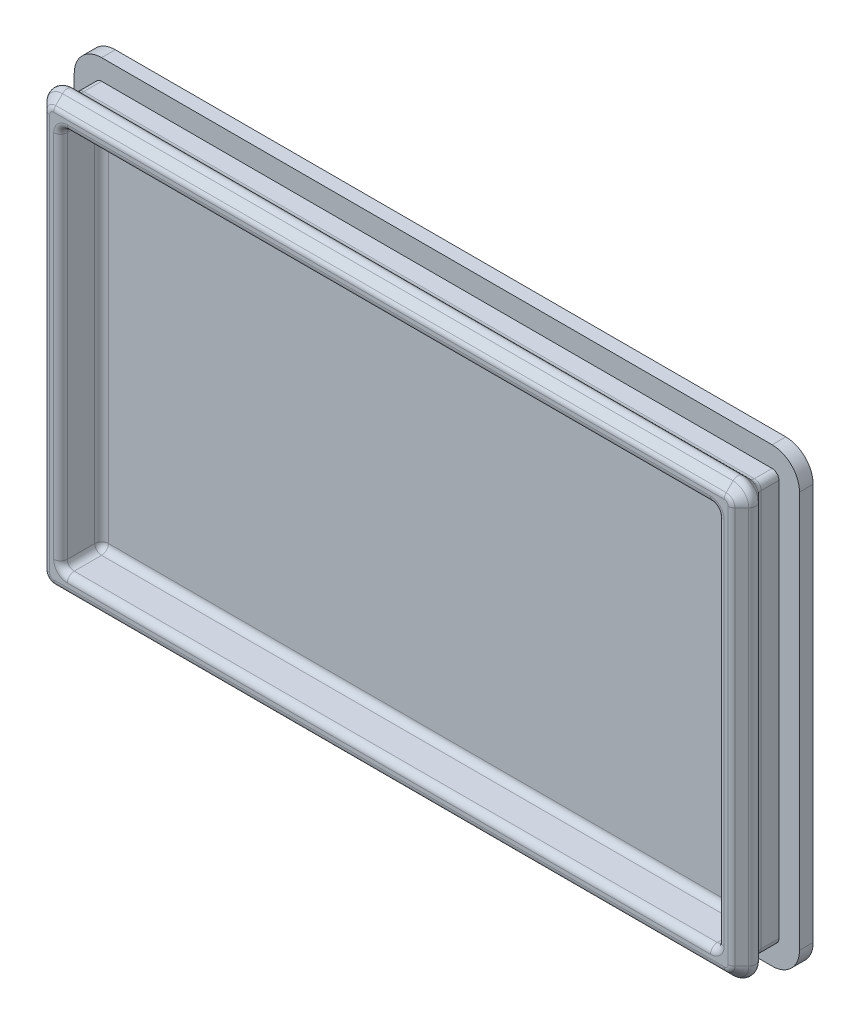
ISO-10303-21;
HEADER;
FILE_DESCRIPTION(('STEP AP214'),'2;1');
FILE_NAME('part.step','',(''),(''),'','','');
FILE_SCHEMA(('AUTOMOTIVE_DESIGN { 1 0 10303 214 1 1 1 1 }'));
ENDSEC;
DATA;
#1=APPLICATION_CONTEXT('core data for automotive mechanical design processes');
#2=APPLICATION_PROTOCOL_DEFINITION('international standard','automotive_design',2000,#1);
#3=PRODUCT_CONTEXT('',#1,'mechanical');
#4=PRODUCT('Part','Part','',(#3));
#5=PRODUCT_RELATED_PRODUCT_CATEGORY('part','',(#4));
#6=PRODUCT_DEFINITION_FORMATION('','',#4);
#7=PRODUCT_DEFINITION_CONTEXT('part definition',#1,'design');
#8=PRODUCT_DEFINITION('design','',#6,#7);
#9=PRODUCT_DEFINITION_SHAPE('','',#8);
#10=(LENGTH_UNIT() NAMED_UNIT(*) SI_UNIT(.MILLI.,.METRE.));
#11=(NAMED_UNIT(*) PLANE_ANGLE_UNIT() SI_UNIT($,.RADIAN.));
#12=(NAMED_UNIT(*) SI_UNIT($,.STERADIAN.) SOLID_ANGLE_UNIT());
#13=UNCERTAINTY_MEASURE_WITH_UNIT(LENGTH_MEASURE(1.E-05),#10,'distance_accuracy_value','');
#14=(GEOMETRIC_REPRESENTATION_CONTEXT(3) GLOBAL_UNCERTAINTY_ASSIGNED_CONTEXT((#13)) GLOBAL_UNIT_ASSIGNED_CONTEXT((#10,
#11,#12)) REPRESENTATION_CONTEXT('',''));
#15=CARTESIAN_POINT('',(0.,0.,0.));
#16=DIRECTION('',(0.,0.,1.));
#17=DIRECTION('',(1.,0.,0.));
#18=AXIS2_PLACEMENT_3D('',#15,#16,#17);
#19=CARTESIAN_POINT('',(-24.4379282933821,-59.1771129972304,86.2951524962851));
#20=DIRECTION('',(0.,0.,1.));
#21=DIRECTION('',(1.,0.,0.));
#22=AXIS2_PLACEMENT_3D('',#19,#20,#21);
#23=PLANE('',#22);
#24=DIRECTION('',(0.,1.,0.));
#25=VECTOR('',#24,1.);
#26=CARTESIAN_POINT('',(-24.7308215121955,-59.1771129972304,86.2951524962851));
#27=LINE('',#26,#25);
#28=CARTESIAN_POINT('',(-24.7308215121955,-30.1771129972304,86.2951524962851));
#29=VERTEX_POINT('',#28);
#30=CARTESIAN_POINT('',(-24.7308215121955,-59.1771129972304,86.2951524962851));
#31=VERTEX_POINT('',#30);
#32=EDGE_CURVE('E449',#29,#31,#27,.F.);
#33=ORIENTED_EDGE('',*,*,#32,.T.);
#34=CARTESIAN_POINT('',(-24.4379282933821,-59.1771129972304,86.2951524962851));
#35=DIRECTION('',(0.,0.,1.));
#36=DIRECTION('',(1.,0.,0.));
#37=AXIS2_PLACEMENT_3D('',#34,#35,#36);
#38=CIRCLE('',#37,0.292893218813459);
#39=CARTESIAN_POINT('',(-24.4379282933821,-59.4700062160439,86.2951524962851));
#40=VERTEX_POINT('',#39);
#41=EDGE_CURVE('E451',#31,#40,#38,.T.);
#42=ORIENTED_EDGE('',*,*,#41,.T.);
#43=DIRECTION('',(-1.,0.,0.));
#44=VECTOR('',#43,1.);
#45=CARTESIAN_POINT('',(24.5620717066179,-59.4700062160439,86.2951524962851));
#46=LINE('',#45,#44);
#47=CARTESIAN_POINT('',(24.5620717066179,-59.4700062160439,86.2951524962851));
#48=VERTEX_POINT('',#47);
#49=EDGE_CURVE('E437',#40,#48,#46,.F.);
#50=ORIENTED_EDGE('',*,*,#49,.T.);
#51=CARTESIAN_POINT('',(24.5620717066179,-59.1771129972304,86.2951524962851));
#52=DIRECTION('',(0.,0.,1.));
#53=DIRECTION('',(1.,0.,0.));
#54=AXIS2_PLACEMENT_3D('',#51,#52,#53);
#55=CIRCLE('',#54,0.292893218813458);
#56=CARTESIAN_POINT('',(24.8549649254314,-59.1771129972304,86.2951524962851));
#57=VERTEX_POINT('',#56);
#58=EDGE_CURVE('E439',#48,#57,#55,.T.);
#59=ORIENTED_EDGE('',*,*,#58,.T.);
#60=DIRECTION('',(0.,-1.,0.));
#61=VECTOR('',#60,1.);
#62=CARTESIAN_POINT('',(24.8549649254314,-30.1771129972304,86.2951524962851));
#63=LINE('',#62,#61);
#64=CARTESIAN_POINT('',(24.8549649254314,-30.1771129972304,86.2951524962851));
#65=VERTEX_POINT('',#64);
#66=EDGE_CURVE('E441',#57,#65,#63,.F.);
#67=ORIENTED_EDGE('',*,*,#66,.T.);
#68=CARTESIAN_POINT('',(24.5620717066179,-30.1771129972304,86.2951524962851));
#69=DIRECTION('',(0.,0.,1.));
#70=DIRECTION('',(1.,0.,0.));
#71=AXIS2_PLACEMENT_3D('',#68,#69,#70);
#72=CIRCLE('',#71,0.292893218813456);
#73=CARTESIAN_POINT('',(24.5620717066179,-29.884219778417,86.2951524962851));
#74=VERTEX_POINT('',#73);
#75=EDGE_CURVE('E443',#65,#74,#72,.T.);
#76=ORIENTED_EDGE('',*,*,#75,.T.);
#77=DIRECTION('',(1.,0.,0.));
#78=VECTOR('',#77,1.);
#79=CARTESIAN_POINT('',(-24.4379282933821,-29.884219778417,86.2951524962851));
#80=LINE('',#79,#78);
#81=CARTESIAN_POINT('',(-24.4379282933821,-29.884219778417,86.2951524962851));
#82=VERTEX_POINT('',#81);
#83=EDGE_CURVE('E445',#74,#82,#80,.F.);
#84=ORIENTED_EDGE('',*,*,#83,.T.);
#85=CARTESIAN_POINT('',(-24.4379282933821,-30.1771129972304,86.2951524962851));
#86=DIRECTION('',(0.,0.,1.));
#87=DIRECTION('',(1.,0.,0.));
#88=AXIS2_PLACEMENT_3D('',#85,#86,#87);
#89=CIRCLE('',#88,0.292893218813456);
#90=EDGE_CURVE('E447',#82,#29,#89,.T.);
#91=ORIENTED_EDGE('',*,*,#90,.T.);
#92=EDGE_LOOP('',(#33,#42,#50,#59,#67,#76,#84,#91));
#93=FACE_BOUND('',#92,.T.);
#94=CARTESIAN_POINT('',(23.5620717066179,-58.1771129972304,86.2951524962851));
#95=DIRECTION('',(0.,0.,1.));
#96=DIRECTION('',(1.,0.,0.));
#97=AXIS2_PLACEMENT_3D('',#94,#95,#96);
#98=CIRCLE('',#97,1.);
#99=CARTESIAN_POINT('',(23.5620717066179,-59.1771129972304,86.2951524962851));
#100=VERTEX_POINT('',#99);
#101=CARTESIAN_POINT('',(24.5620717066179,-58.1771129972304,86.2951524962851));
#102=VERTEX_POINT('',#101);
#103=EDGE_CURVE('E472',#100,#102,#98,.T.);
#104=ORIENTED_EDGE('',*,*,#103,.F.);
#105=DIRECTION('',(1.,0.,0.));
#106=VECTOR('',#105,1.);
#107=CARTESIAN_POINT('',(-23.9379282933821,-59.1771129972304,86.2951524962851));
#108=LINE('',#107,#106);
#109=CARTESIAN_POINT('',(-23.4379282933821,-59.1771129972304,86.2951524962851));
#110=VERTEX_POINT('',#109);
#111=EDGE_CURVE('E469',#100,#110,#108,.F.);
#112=ORIENTED_EDGE('',*,*,#111,.T.);
#113=CARTESIAN_POINT('',(-23.4379282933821,-58.1771129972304,86.2951524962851));
#114=DIRECTION('',(0.,0.,1.));
#115=DIRECTION('',(1.,0.,0.));
#116=AXIS2_PLACEMENT_3D('',#113,#114,#115);
#117=CIRCLE('',#116,1.);
#118=CARTESIAN_POINT('',(-24.4379282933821,-58.1771129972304,86.2951524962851));
#119=VERTEX_POINT('',#118);
#120=EDGE_CURVE('E466',#119,#110,#117,.T.);
#121=ORIENTED_EDGE('',*,*,#120,.F.);
#122=DIRECTION('',(0.,-1.,0.));
#123=VECTOR('',#122,1.);
#124=CARTESIAN_POINT('',(-24.4379282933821,-30.6771129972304,86.2951524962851));
#125=LINE('',#124,#123);
#126=CARTESIAN_POINT('',(-24.4379282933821,-31.1771129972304,86.2951524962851));
#127=VERTEX_POINT('',#126);
#128=EDGE_CURVE('E462',#119,#127,#125,.F.);
#129=ORIENTED_EDGE('',*,*,#128,.T.);
#130=CARTESIAN_POINT('',(-23.4379282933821,-31.1771129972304,86.2951524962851));
#131=DIRECTION('',(0.,0.,1.));
#132=DIRECTION('',(1.,0.,0.));
#133=AXIS2_PLACEMENT_3D('',#130,#131,#132);
#134=CIRCLE('',#133,1.);
#135=CARTESIAN_POINT('',(-23.4379282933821,-30.1771129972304,86.2951524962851));
#136=VERTEX_POINT('',#135);
#137=EDGE_CURVE('E459',#136,#127,#134,.T.);
#138=ORIENTED_EDGE('',*,*,#137,.F.);
#139=DIRECTION('',(-1.,0.,0.));
#140=VECTOR('',#139,1.);
#141=CARTESIAN_POINT('',(24.0620717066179,-30.1771129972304,86.2951524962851));
#142=LINE('',#141,#140);
#143=CARTESIAN_POINT('',(23.5620717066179,-30.1771129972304,86.2951524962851));
#144=VERTEX_POINT('',#143);
#145=EDGE_CURVE('E457',#136,#144,#142,.F.);
#146=ORIENTED_EDGE('',*,*,#145,.T.);
#147=CARTESIAN_POINT('',(23.5620717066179,-31.1771129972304,86.2951524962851));
#148=DIRECTION('',(0.,0.,1.));
#149=DIRECTION('',(1.,0.,0.));
#150=AXIS2_PLACEMENT_3D('',#147,#148,#149);
#151=CIRCLE('',#150,1.);
#152=CARTESIAN_POINT('',(24.5620717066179,-31.1771129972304,86.2951524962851));
#153=VERTEX_POINT('',#152);
#154=EDGE_CURVE('E454',#153,#144,#151,.T.);
#155=ORIENTED_EDGE('',*,*,#154,.F.);
#156=DIRECTION('',(0.,1.,0.));
#157=VECTOR('',#156,1.);
#158=CARTESIAN_POINT('',(24.5620717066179,-58.6771129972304,86.2951524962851));
#159=LINE('',#158,#157);
#160=EDGE_CURVE('E464',#153,#102,#159,.F.);
#161=ORIENTED_EDGE('',*,*,#160,.T.);
#162=EDGE_LOOP('',(#104,#112,#121,#129,#138,#146,#155,#161));
#163=FACE_BOUND('',#162,.T.);
#164=ADVANCED_FACE('F37',(#93,#163),#23,.T.);
#165=CARTESIAN_POINT('',(-24.4379282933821,-59.1771129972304,84.2951524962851));
#166=DIRECTION('',(0.,0.,-1.));
#167=DIRECTION('',(-1.,0.,0.));
#168=AXIS2_PLACEMENT_3D('',#165,#166,#167);
#169=CYLINDRICAL_SURFACE('',#168,0.5);
#170=DIRECTION('',(0.,0.,-1.));
#171=VECTOR('',#170,1.);
#172=CARTESIAN_POINT('',(-24.4379282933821,-59.6771129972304,84.2951524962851));
#173=LINE('',#172,#171);
#174=CARTESIAN_POINT('',(-24.4379282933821,-59.6771129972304,84.0880457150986));
#175=VERTEX_POINT('',#174);
#176=CARTESIAN_POINT('',(-24.4379282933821,-59.6771129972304,82.7951524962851));
#177=VERTEX_POINT('',#176);
#178=EDGE_CURVE('E413',#175,#177,#173,.T.);
#179=ORIENTED_EDGE('',*,*,#178,.F.);
#180=CARTESIAN_POINT('',(-24.4379282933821,-59.1771129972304,84.0880457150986));
#181=DIRECTION('',(0.,0.,-1.));
#182=DIRECTION('',(-1.,0.,0.));
#183=AXIS2_PLACEMENT_3D('',#180,#181,#182);
#184=CIRCLE('',#183,0.5);
#185=CARTESIAN_POINT('',(-24.9379282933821,-59.1771129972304,84.0880457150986));
#186=VERTEX_POINT('',#185);
#187=EDGE_CURVE('E574',#175,#186,#184,.T.);
#188=ORIENTED_EDGE('',*,*,#187,.T.);
#189=DIRECTION('',(0.,0.,-1.));
#190=VECTOR('',#189,1.);
#191=CARTESIAN_POINT('',(-24.9379282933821,-59.1771129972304,84.2951524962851));
#192=LINE('',#191,#190);
#193=CARTESIAN_POINT('',(-24.9379282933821,-59.1771129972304,82.7951524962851));
#194=VERTEX_POINT('',#193);
#195=EDGE_CURVE('E412',#186,#194,#192,.T.);
#196=ORIENTED_EDGE('',*,*,#195,.T.);
#197=CARTESIAN_POINT('',(-24.4379282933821,-59.1771129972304,82.7951524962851));
#198=DIRECTION('',(0.,0.,-1.));
#199=DIRECTION('',(-1.,0.,0.));
#200=AXIS2_PLACEMENT_3D('',#197,#198,#199);
#201=CIRCLE('',#200,0.5);
#202=EDGE_CURVE('E383',#177,#194,#201,.T.);
#203=ORIENTED_EDGE('',*,*,#202,.F.);
#204=EDGE_LOOP('',(#179,#188,#196,#203));
#205=FACE_BOUND('',#204,.T.);
#206=ADVANCED_FACE('F837',(#205),#169,.T.);
#207=CARTESIAN_POINT('',(24.5620717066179,-59.6771129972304,84.2951524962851));
#208=DIRECTION('',(0.,-1.,0.));
#209=DIRECTION('',(0.,0.,-1.));
#210=AXIS2_PLACEMENT_3D('',#207,#208,#209);
#211=PLANE('',#210);
#212=DIRECTION('',(0.,0.,-1.));
#213=VECTOR('',#212,1.);
#214=CARTESIAN_POINT('',(24.5620717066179,-59.6771129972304,84.2951524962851));
#215=LINE('',#214,#213);
#216=CARTESIAN_POINT('',(24.5620717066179,-59.6771129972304,84.0880457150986));
#217=VERTEX_POINT('',#216);
#218=CARTESIAN_POINT('',(24.5620717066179,-59.6771129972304,82.7951524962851));
#219=VERTEX_POINT('',#218);
#220=EDGE_CURVE('E416',#217,#219,#215,.T.);
#221=ORIENTED_EDGE('',*,*,#220,.F.);
#222=DIRECTION('',(1.,0.,0.));
#223=VECTOR('',#222,1.);
#224=CARTESIAN_POINT('',(24.5620717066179,-59.6771129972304,84.0880457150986));
#225=LINE('',#224,#223);
#226=EDGE_CURVE('E11',#217,#175,#225,.F.);
#227=ORIENTED_EDGE('',*,*,#226,.T.);
#228=ORIENTED_EDGE('',*,*,#178,.T.);
#229=DIRECTION('',(-1.,0.,0.));
#230=VECTOR('',#229,1.);
#231=CARTESIAN_POINT('',(24.5620717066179,-59.6771129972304,82.7951524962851));
#232=LINE('',#231,#230);
#233=EDGE_CURVE('E409',#219,#177,#232,.T.);
#234=ORIENTED_EDGE('',*,*,#233,.F.);
#235=EDGE_LOOP('',(#221,#227,#228,#234));
#236=FACE_BOUND('',#235,.T.);
#237=ADVANCED_FACE('F843',(#236),#211,.T.);
#238=CARTESIAN_POINT('',(24.5620717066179,-59.1771129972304,84.2951524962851));
#239=DIRECTION('',(0.,0.,-1.));
#240=DIRECTION('',(-1.,0.,0.));
#241=AXIS2_PLACEMENT_3D('',#238,#239,#240);
#242=CYLINDRICAL_SURFACE('',#241,0.5);
#243=DIRECTION('',(0.,0.,-1.));
#244=VECTOR('',#243,1.);
#245=CARTESIAN_POINT('',(25.0620717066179,-59.1771129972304,84.2951524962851));
#246=LINE('',#245,#244);
#247=CARTESIAN_POINT('',(25.0620717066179,-59.1771129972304,84.0880457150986));
#248=VERTEX_POINT('',#247);
#249=CARTESIAN_POINT('',(25.0620717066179,-59.1771129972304,82.7951524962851));
#250=VERTEX_POINT('',#249);
#251=EDGE_CURVE('E418',#248,#250,#246,.T.);
#252=ORIENTED_EDGE('',*,*,#251,.F.);
#253=CARTESIAN_POINT('',(24.5620717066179,-59.1771129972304,84.0880457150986));
#254=DIRECTION('',(0.,0.,-1.));
#255=DIRECTION('',(-1.,0.,0.));
#256=AXIS2_PLACEMENT_3D('',#253,#254,#255);
#257=CIRCLE('',#256,0.5);
#258=EDGE_CURVE('E557',#248,#217,#257,.T.);
#259=ORIENTED_EDGE('',*,*,#258,.T.);
#260=ORIENTED_EDGE('',*,*,#220,.T.);
#261=CARTESIAN_POINT('',(24.5620717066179,-59.1771129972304,82.7951524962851));
#262=DIRECTION('',(0.,0.,-1.));
#263=DIRECTION('',(-1.,0.,0.));
#264=AXIS2_PLACEMENT_3D('',#261,#262,#263);
#265=CIRCLE('',#264,0.5);
#266=EDGE_CURVE('E406',#250,#219,#265,.T.);
#267=ORIENTED_EDGE('',*,*,#266,.F.);
#268=EDGE_LOOP('',(#252,#259,#260,#267));
#269=FACE_BOUND('',#268,.T.);
#270=ADVANCED_FACE('F1611',(#269),#242,.T.);
#271=CARTESIAN_POINT('',(25.0620717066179,-30.1771129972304,84.2951524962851));
#272=DIRECTION('',(1.,0.,0.));
#273=DIRECTION('',(0.,1.,0.));
#274=AXIS2_PLACEMENT_3D('',#271,#272,#273);
#275=PLANE('',#274);
#276=DIRECTION('',(0.,0.,-1.));
#277=VECTOR('',#276,1.);
#278=CARTESIAN_POINT('',(25.0620717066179,-30.1771129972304,84.2951524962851));
#279=LINE('',#278,#277);
#280=CARTESIAN_POINT('',(25.0620717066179,-30.1771129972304,84.0880457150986));
#281=VERTEX_POINT('',#280);
#282=CARTESIAN_POINT('',(25.0620717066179,-30.1771129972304,82.7951524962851));
#283=VERTEX_POINT('',#282);
#284=EDGE_CURVE('E420',#281,#283,#279,.T.);
#285=ORIENTED_EDGE('',*,*,#284,.F.);
#286=DIRECTION('',(0.,1.,0.));
#287=VECTOR('',#286,1.);
#288=CARTESIAN_POINT('',(25.0620717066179,-30.1771129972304,84.0880457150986));
#289=LINE('',#288,#287);
#290=EDGE_CURVE('E560',#281,#248,#289,.F.);
#291=ORIENTED_EDGE('',*,*,#290,.T.);
#292=ORIENTED_EDGE('',*,*,#251,.T.);
#293=DIRECTION('',(0.,-1.,0.));
#294=VECTOR('',#293,1.);
#295=CARTESIAN_POINT('',(25.0620717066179,-30.1771129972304,82.7951524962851));
#296=LINE('',#295,#294);
#297=EDGE_CURVE('E403',#283,#250,#296,.T.);
#298=ORIENTED_EDGE('',*,*,#297,.F.);
#299=EDGE_LOOP('',(#285,#291,#292,#298));
#300=FACE_BOUND('',#299,.T.);
#301=ADVANCED_FACE('F1602',(#300),#275,.T.);
#302=CARTESIAN_POINT('',(24.5620717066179,-30.1771129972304,84.2951524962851));
#303=DIRECTION('',(0.,0.,-1.));
#304=DIRECTION('',(-1.,0.,0.));
#305=AXIS2_PLACEMENT_3D('',#302,#303,#304);
#306=CYLINDRICAL_SURFACE('',#305,0.5);
#307=DIRECTION('',(0.,0.,-1.));
#308=VECTOR('',#307,1.);
#309=CARTESIAN_POINT('',(24.5620717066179,-29.6771129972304,84.2951524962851));
#310=LINE('',#309,#308);
#311=CARTESIAN_POINT('',(24.5620717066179,-29.6771129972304,84.0880457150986));
#312=VERTEX_POINT('',#311);
#313=CARTESIAN_POINT('',(24.5620717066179,-29.6771129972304,82.7951524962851));
#314=VERTEX_POINT('',#313);
#315=EDGE_CURVE('E422',#312,#314,#310,.T.);
#316=ORIENTED_EDGE('',*,*,#315,.F.);
#317=CARTESIAN_POINT('',(24.5620717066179,-30.1771129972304,84.0880457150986));
#318=DIRECTION('',(0.,0.,-1.));
#319=DIRECTION('',(-1.,0.,0.));
#320=AXIS2_PLACEMENT_3D('',#317,#318,#319);
#321=CIRCLE('',#320,0.5);
#322=EDGE_CURVE('E562',#312,#281,#321,.T.);
#323=ORIENTED_EDGE('',*,*,#322,.T.);
#324=ORIENTED_EDGE('',*,*,#284,.T.);
#325=CARTESIAN_POINT('',(24.5620717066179,-30.1771129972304,82.7951524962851));
#326=DIRECTION('',(0.,0.,-1.));
#327=DIRECTION('',(-1.,0.,0.));
#328=AXIS2_PLACEMENT_3D('',#325,#326,#327);
#329=CIRCLE('',#328,0.5);
#330=EDGE_CURVE('E400',#314,#283,#329,.T.);
#331=ORIENTED_EDGE('',*,*,#330,.F.);
#332=EDGE_LOOP('',(#316,#323,#324,#331));
#333=FACE_BOUND('',#332,.T.);
#334=ADVANCED_FACE('F1593',(#333),#306,.T.);
#335=CARTESIAN_POINT('',(-24.4379282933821,-29.6771129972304,84.2951524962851));
#336=DIRECTION('',(0.,1.,0.));
#337=DIRECTION('',(0.,0.,1.));
#338=AXIS2_PLACEMENT_3D('',#335,#336,#337);
#339=PLANE('',#338);
#340=DIRECTION('',(0.,0.,-1.));
#341=VECTOR('',#340,1.);
#342=CARTESIAN_POINT('',(-24.4379282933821,-29.6771129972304,84.2951524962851));
#343=LINE('',#342,#341);
#344=CARTESIAN_POINT('',(-24.4379282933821,-29.6771129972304,84.0880457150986));
#345=VERTEX_POINT('',#344);
#346=CARTESIAN_POINT('',(-24.4379282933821,-29.6771129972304,82.7951524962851));
#347=VERTEX_POINT('',#346);
#348=EDGE_CURVE('E424',#345,#347,#343,.T.);
#349=ORIENTED_EDGE('',*,*,#348,.F.);
#350=DIRECTION('',(-1.,0.,0.));
#351=VECTOR('',#350,1.);
#352=CARTESIAN_POINT('',(-24.4379282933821,-29.6771129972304,84.0880457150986));
#353=LINE('',#352,#351);
#354=EDGE_CURVE('E568',#345,#312,#353,.F.);
#355=ORIENTED_EDGE('',*,*,#354,.T.);
#356=ORIENTED_EDGE('',*,*,#315,.T.);
#357=DIRECTION('',(1.,0.,0.));
#358=VECTOR('',#357,1.);
#359=CARTESIAN_POINT('',(-24.4379282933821,-29.6771129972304,82.7951524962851));
#360=LINE('',#359,#358);
#361=EDGE_CURVE('E397',#347,#314,#360,.T.);
#362=ORIENTED_EDGE('',*,*,#361,.F.);
#363=EDGE_LOOP('',(#349,#355,#356,#362));
#364=FACE_BOUND('',#363,.T.);
#365=ADVANCED_FACE('F1584',(#364),#339,.T.);
#366=CARTESIAN_POINT('',(-24.4379282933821,-30.1771129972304,84.2951524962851));
#367=DIRECTION('',(0.,0.,-1.));
#368=DIRECTION('',(-1.,0.,0.));
#369=AXIS2_PLACEMENT_3D('',#366,#367,#368);
#370=CYLINDRICAL_SURFACE('',#369,0.5);
#371=DIRECTION('',(0.,0.,-1.));
#372=VECTOR('',#371,1.);
#373=CARTESIAN_POINT('',(-24.9379282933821,-30.1771129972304,84.2951524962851));
#374=LINE('',#373,#372);
#375=CARTESIAN_POINT('',(-24.9379282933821,-30.1771129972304,84.0880457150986));
#376=VERTEX_POINT('',#375);
#377=CARTESIAN_POINT('',(-24.9379282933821,-30.1771129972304,82.7951524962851));
#378=VERTEX_POINT('',#377);
#379=EDGE_CURVE('E426',#376,#378,#374,.T.);
#380=ORIENTED_EDGE('',*,*,#379,.F.);
#381=CARTESIAN_POINT('',(-24.4379282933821,-30.1771129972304,84.0880457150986));
#382=DIRECTION('',(0.,0.,-1.));
#383=DIRECTION('',(-1.,0.,0.));
#384=AXIS2_PLACEMENT_3D('',#381,#382,#383);
#385=CIRCLE('',#384,0.5);
#386=EDGE_CURVE('E570',#376,#345,#385,.T.);
#387=ORIENTED_EDGE('',*,*,#386,.T.);
#388=ORIENTED_EDGE('',*,*,#348,.T.);
#389=CARTESIAN_POINT('',(-24.4379282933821,-30.1771129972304,82.7951524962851));
#390=DIRECTION('',(0.,0.,-1.));
#391=DIRECTION('',(-1.,0.,0.));
#392=AXIS2_PLACEMENT_3D('',#389,#390,#391);
#393=CIRCLE('',#392,0.5);
#394=EDGE_CURVE('E394',#378,#347,#393,.T.);
#395=ORIENTED_EDGE('',*,*,#394,.F.);
#396=EDGE_LOOP('',(#380,#387,#388,#395));
#397=FACE_BOUND('',#396,.T.);
#398=ADVANCED_FACE('F1575',(#397),#370,.T.);
#399=CARTESIAN_POINT('',(-24.9379282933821,-59.1771129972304,84.2951524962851));
#400=DIRECTION('',(-1.,0.,0.));
#401=DIRECTION('',(0.,-1.,0.));
#402=AXIS2_PLACEMENT_3D('',#399,#400,#401);
#403=PLANE('',#402);
#404=ORIENTED_EDGE('',*,*,#195,.F.);
#405=DIRECTION('',(0.,-1.,0.));
#406=VECTOR('',#405,1.);
#407=CARTESIAN_POINT('',(-24.9379282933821,-59.1771129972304,84.0880457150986));
#408=LINE('',#407,#406);
#409=EDGE_CURVE('E572',#186,#376,#408,.F.);
#410=ORIENTED_EDGE('',*,*,#409,.T.);
#411=ORIENTED_EDGE('',*,*,#379,.T.);
#412=DIRECTION('',(0.,1.,0.));
#413=VECTOR('',#412,1.);
#414=CARTESIAN_POINT('',(-24.9379282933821,-59.1771129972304,82.7951524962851));
#415=LINE('',#414,#413);
#416=EDGE_CURVE('E386',#194,#378,#415,.T.);
#417=ORIENTED_EDGE('',*,*,#416,.F.);
#418=EDGE_LOOP('',(#404,#410,#411,#417));
#419=FACE_BOUND('',#418,.T.);
#420=ADVANCED_FACE('F916',(#419),#403,.T.);
#421=CARTESIAN_POINT('',(24.5620717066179,-30.1771129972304,82.7951524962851));
#422=DIRECTION('',(0.,0.,-1.));
#423=DIRECTION('',(-1.,0.,0.));
#424=AXIS2_PLACEMENT_3D('',#421,#422,#423);
#425=PLANE('',#424);
#426=CARTESIAN_POINT('',(24.5620717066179,-30.1771129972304,82.7951524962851));
#427=DIRECTION('',(0.,0.,-1.));
#428=DIRECTION('',(-1.,0.,0.));
#429=AXIS2_PLACEMENT_3D('',#426,#427,#428);
#430=CIRCLE('',#429,2.);
#431=CARTESIAN_POINT('',(24.5620717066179,-28.1771129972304,82.7951524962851));
#432=VERTEX_POINT('',#431);
#433=CARTESIAN_POINT('',(26.5620717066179,-30.1771129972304,82.7951524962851));
#434=VERTEX_POINT('',#433);
#435=EDGE_CURVE('E382',#432,#434,#430,.T.);
#436=ORIENTED_EDGE('',*,*,#435,.F.);
#437=DIRECTION('',(1.,0.,0.));
#438=VECTOR('',#437,1.);
#439=CARTESIAN_POINT('',(-24.4379282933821,-28.1771129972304,82.7951524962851));
#440=LINE('',#439,#438);
#441=CARTESIAN_POINT('',(-24.4379282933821,-28.1771129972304,82.7951524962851));
#442=VERTEX_POINT('',#441);
#443=EDGE_CURVE('E378',#442,#432,#440,.T.);
#444=ORIENTED_EDGE('',*,*,#443,.F.);
#445=CARTESIAN_POINT('',(-24.4379282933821,-30.1771129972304,82.7951524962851));
#446=DIRECTION('',(0.,0.,-1.));
#447=DIRECTION('',(-1.,0.,0.));
#448=AXIS2_PLACEMENT_3D('',#445,#446,#447);
#449=CIRCLE('',#448,2.);
#450=CARTESIAN_POINT('',(-26.4379282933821,-30.1771129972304,82.7951524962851));
#451=VERTEX_POINT('',#450);
#452=EDGE_CURVE('E787',#451,#442,#449,.T.);
#453=ORIENTED_EDGE('',*,*,#452,.F.);
#454=DIRECTION('',(0.,1.,0.));
#455=VECTOR('',#454,1.);
#456=CARTESIAN_POINT('',(-26.4379282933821,-59.1771129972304,82.7951524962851));
#457=LINE('',#456,#455);
#458=CARTESIAN_POINT('',(-26.4379282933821,-59.1771129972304,82.7951524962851));
#459=VERTEX_POINT('',#458);
#460=EDGE_CURVE('E785',#459,#451,#457,.T.);
#461=ORIENTED_EDGE('',*,*,#460,.F.);
#462=CARTESIAN_POINT('',(-24.4379282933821,-59.1771129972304,82.7951524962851));
#463=DIRECTION('',(0.,0.,-1.));
#464=DIRECTION('',(-1.,0.,0.));
#465=AXIS2_PLACEMENT_3D('',#462,#463,#464);
#466=CIRCLE('',#465,2.);
#467=CARTESIAN_POINT('',(-24.4379282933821,-61.1771129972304,82.7951524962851));
#468=VERTEX_POINT('',#467);
#469=EDGE_CURVE('E783',#468,#459,#466,.T.);
#470=ORIENTED_EDGE('',*,*,#469,.F.);
#471=DIRECTION('',(-1.,0.,0.));
#472=VECTOR('',#471,1.);
#473=CARTESIAN_POINT('',(24.5620717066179,-61.1771129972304,82.7951524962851));
#474=LINE('',#473,#472);
#475=CARTESIAN_POINT('',(24.5620717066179,-61.1771129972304,82.7951524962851));
#476=VERTEX_POINT('',#475);
#477=EDGE_CURVE('E781',#476,#468,#474,.T.);
#478=ORIENTED_EDGE('',*,*,#477,.F.);
#479=CARTESIAN_POINT('',(24.5620717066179,-59.1771129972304,82.7951524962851));
#480=DIRECTION('',(0.,0.,-1.));
#481=DIRECTION('',(-1.,0.,0.));
#482=AXIS2_PLACEMENT_3D('',#479,#480,#481);
#483=CIRCLE('',#482,2.);
#484=CARTESIAN_POINT('',(26.5620717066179,-59.1771129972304,82.7951524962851));
#485=VERTEX_POINT('',#484);
#486=EDGE_CURVE('E779',#485,#476,#483,.T.);
#487=ORIENTED_EDGE('',*,*,#486,.F.);
#488=DIRECTION('',(0.,-1.,0.));
#489=VECTOR('',#488,1.);
#490=CARTESIAN_POINT('',(26.5620717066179,-30.1771129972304,82.7951524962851));
#491=LINE('',#490,#489);
#492=EDGE_CURVE('E777',#434,#485,#491,.T.);
#493=ORIENTED_EDGE('',*,*,#492,.F.);
#494=EDGE_LOOP('',(#436,#444,#453,#461,#470,#478,#487,#493));
#495=FACE_BOUND('',#494,.T.);
#496=ORIENTED_EDGE('',*,*,#233,.T.);
#497=ORIENTED_EDGE('',*,*,#202,.T.);
#498=ORIENTED_EDGE('',*,*,#416,.T.);
#499=ORIENTED_EDGE('',*,*,#394,.T.);
#500=ORIENTED_EDGE('',*,*,#361,.T.);
#501=ORIENTED_EDGE('',*,*,#330,.T.);
#502=ORIENTED_EDGE('',*,*,#297,.T.);
#503=ORIENTED_EDGE('',*,*,#266,.T.);
#504=EDGE_LOOP('',(#496,#497,#498,#499,#500,#501,#502,#503));
#505=FACE_BOUND('',#504,.T.);
#506=ADVANCED_FACE('F813',(#495,#505),#425,.F.);
#507=CARTESIAN_POINT('',(24.5620717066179,-30.1771129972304,81.7951524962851));
#508=DIRECTION('',(0.,0.,1.));
#509=DIRECTION('',(1.,0.,0.));
#510=AXIS2_PLACEMENT_3D('',#507,#508,#509);
#511=CYLINDRICAL_SURFACE('',#510,2.);
#512=ORIENTED_EDGE('',*,*,#435,.T.);
#513=DIRECTION('',(0.,0.,1.));
#514=VECTOR('',#513,1.);
#515=CARTESIAN_POINT('',(26.5620717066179,-30.1771129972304,81.7951524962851));
#516=LINE('',#515,#514);
#517=CARTESIAN_POINT('',(26.5620717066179,-30.1771129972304,81.7951524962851));
#518=VERTEX_POINT('',#517);
#519=EDGE_CURVE('E362',#518,#434,#516,.T.);
#520=ORIENTED_EDGE('',*,*,#519,.F.);
#521=CARTESIAN_POINT('',(24.5620717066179,-30.1771129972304,81.7951524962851));
#522=DIRECTION('',(0.,0.,-1.));
#523=DIRECTION('',(-1.,0.,0.));
#524=AXIS2_PLACEMENT_3D('',#521,#522,#523);
#525=CIRCLE('',#524,2.);
#526=CARTESIAN_POINT('',(24.5620717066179,-28.1771129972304,81.7951524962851));
#527=VERTEX_POINT('',#526);
#528=EDGE_CURVE('E369',#527,#518,#525,.T.);
#529=ORIENTED_EDGE('',*,*,#528,.F.);
#530=DIRECTION('',(0.,0.,1.));
#531=VECTOR('',#530,1.);
#532=CARTESIAN_POINT('',(24.5620717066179,-28.1771129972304,81.7951524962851));
#533=LINE('',#532,#531);
#534=EDGE_CURVE('E775',#527,#432,#533,.T.);
#535=ORIENTED_EDGE('',*,*,#534,.T.);
#536=EDGE_LOOP('',(#512,#520,#529,#535));
#537=FACE_BOUND('',#536,.T.);
#538=ADVANCED_FACE('F380',(#537),#511,.T.);
#539=CARTESIAN_POINT('',(26.5620717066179,-30.1771129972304,81.7951524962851));
#540=DIRECTION('',(-1.,0.,0.));
#541=DIRECTION('',(0.,-1.,0.));
#542=AXIS2_PLACEMENT_3D('',#539,#540,#541);
#543=PLANE('',#542);
#544=ORIENTED_EDGE('',*,*,#492,.T.);
#545=DIRECTION('',(0.,0.,1.));
#546=VECTOR('',#545,1.);
#547=CARTESIAN_POINT('',(26.5620717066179,-59.1771129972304,81.7951524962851));
#548=LINE('',#547,#546);
#549=CARTESIAN_POINT('',(26.5620717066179,-59.1771129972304,81.7951524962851));
#550=VERTEX_POINT('',#549);
#551=EDGE_CURVE('E365',#550,#485,#548,.T.);
#552=ORIENTED_EDGE('',*,*,#551,.F.);
#553=DIRECTION('',(0.,-1.,0.));
#554=VECTOR('',#553,1.);
#555=CARTESIAN_POINT('',(26.5620717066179,-30.1771129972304,81.7951524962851));
#556=LINE('',#555,#554);
#557=EDGE_CURVE('E358',#518,#550,#556,.T.);
#558=ORIENTED_EDGE('',*,*,#557,.F.);
#559=ORIENTED_EDGE('',*,*,#519,.T.);
#560=EDGE_LOOP('',(#544,#552,#558,#559));
#561=FACE_BOUND('',#560,.T.);
#562=ADVANCED_FACE('F360',(#561),#543,.F.);
#563=CARTESIAN_POINT('',(24.5620717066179,-59.1771129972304,81.7951524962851));
#564=DIRECTION('',(0.,0.,1.));
#565=DIRECTION('',(1.,0.,0.));
#566=AXIS2_PLACEMENT_3D('',#563,#564,#565);
#567=CYLINDRICAL_SURFACE('',#566,2.);
#568=ORIENTED_EDGE('',*,*,#486,.T.);
#569=DIRECTION('',(0.,0.,1.));
#570=VECTOR('',#569,1.);
#571=CARTESIAN_POINT('',(24.5620717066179,-61.1771129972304,81.7951524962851));
#572=LINE('',#571,#570);
#573=CARTESIAN_POINT('',(24.5620717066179,-61.1771129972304,81.7951524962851));
#574=VERTEX_POINT('',#573);
#575=EDGE_CURVE('E388',#574,#476,#572,.T.);
#576=ORIENTED_EDGE('',*,*,#575,.F.);
#577=CARTESIAN_POINT('',(24.5620717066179,-59.1771129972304,81.7951524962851));
#578=DIRECTION('',(0.,0.,-1.));
#579=DIRECTION('',(-1.,0.,0.));
#580=AXIS2_PLACEMENT_3D('',#577,#578,#579);
#581=CIRCLE('',#580,2.);
#582=EDGE_CURVE('E368',#550,#574,#581,.T.);
#583=ORIENTED_EDGE('',*,*,#582,.F.);
#584=ORIENTED_EDGE('',*,*,#551,.T.);
#585=EDGE_LOOP('',(#568,#576,#583,#584));
#586=FACE_BOUND('',#585,.T.);
#587=ADVANCED_FACE('F827',(#586),#567,.T.);
#588=CARTESIAN_POINT('',(24.5620717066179,-61.1771129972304,81.7951524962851));
#589=DIRECTION('',(0.,1.,0.));
#590=DIRECTION('',(0.,0.,1.));
#591=AXIS2_PLACEMENT_3D('',#588,#589,#590);
#592=PLANE('',#591);
#593=ORIENTED_EDGE('',*,*,#477,.T.);
#594=DIRECTION('',(0.,0.,1.));
#595=VECTOR('',#594,1.);
#596=CARTESIAN_POINT('',(-24.4379282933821,-61.1771129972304,81.7951524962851));
#597=LINE('',#596,#595);
#598=CARTESIAN_POINT('',(-24.4379282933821,-61.1771129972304,81.7951524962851));
#599=VERTEX_POINT('',#598);
#600=EDGE_CURVE('E800',#599,#468,#597,.T.);
#601=ORIENTED_EDGE('',*,*,#600,.F.);
#602=DIRECTION('',(-1.,0.,0.));
#603=VECTOR('',#602,1.);
#604=CARTESIAN_POINT('',(24.5620717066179,-61.1771129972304,81.7951524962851));
#605=LINE('',#604,#603);
#606=EDGE_CURVE('E766',#574,#599,#605,.T.);
#607=ORIENTED_EDGE('',*,*,#606,.F.);
#608=ORIENTED_EDGE('',*,*,#575,.T.);
#609=EDGE_LOOP('',(#593,#601,#607,#608));
#610=FACE_BOUND('',#609,.T.);
#611=ADVANCED_FACE('F807',(#610),#592,.F.);
#612=CARTESIAN_POINT('',(-24.4379282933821,-59.1771129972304,81.7951524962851));
#613=DIRECTION('',(0.,0.,1.));
#614=DIRECTION('',(1.,0.,0.));
#615=AXIS2_PLACEMENT_3D('',#612,#613,#614);
#616=CYLINDRICAL_SURFACE('',#615,2.);
#617=ORIENTED_EDGE('',*,*,#469,.T.);
#618=DIRECTION('',(0.,0.,1.));
#619=VECTOR('',#618,1.);
#620=CARTESIAN_POINT('',(-26.4379282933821,-59.1771129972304,81.7951524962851));
#621=LINE('',#620,#619);
#622=CARTESIAN_POINT('',(-26.4379282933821,-59.1771129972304,81.7951524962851));
#623=VERTEX_POINT('',#622);
#624=EDGE_CURVE('E797',#623,#459,#621,.T.);
#625=ORIENTED_EDGE('',*,*,#624,.F.);
#626=CARTESIAN_POINT('',(-24.4379282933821,-59.1771129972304,81.7951524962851));
#627=DIRECTION('',(0.,0.,-1.));
#628=DIRECTION('',(-1.,0.,0.));
#629=AXIS2_PLACEMENT_3D('',#626,#627,#628);
#630=CIRCLE('',#629,2.);
#631=EDGE_CURVE('E768',#599,#623,#630,.T.);
#632=ORIENTED_EDGE('',*,*,#631,.F.);
#633=ORIENTED_EDGE('',*,*,#600,.T.);
#634=EDGE_LOOP('',(#617,#625,#632,#633));
#635=FACE_BOUND('',#634,.T.);
#636=ADVANCED_FACE('F819',(#635),#616,.T.);
#637=CARTESIAN_POINT('',(-26.4379282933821,-59.1771129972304,81.7951524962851));
#638=DIRECTION('',(1.,0.,0.));
#639=DIRECTION('',(0.,1.,0.));
#640=AXIS2_PLACEMENT_3D('',#637,#638,#639);
#641=PLANE('',#640);
#642=ORIENTED_EDGE('',*,*,#460,.T.);
#643=DIRECTION('',(0.,0.,1.));
#644=VECTOR('',#643,1.);
#645=CARTESIAN_POINT('',(-26.4379282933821,-30.1771129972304,81.7951524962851));
#646=LINE('',#645,#644);
#647=CARTESIAN_POINT('',(-26.4379282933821,-30.1771129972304,81.7951524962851));
#648=VERTEX_POINT('',#647);
#649=EDGE_CURVE('E794',#648,#451,#646,.T.);
#650=ORIENTED_EDGE('',*,*,#649,.F.);
#651=DIRECTION('',(0.,1.,0.));
#652=VECTOR('',#651,1.);
#653=CARTESIAN_POINT('',(-26.4379282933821,-59.1771129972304,81.7951524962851));
#654=LINE('',#653,#652);
#655=EDGE_CURVE('E770',#623,#648,#654,.T.);
#656=ORIENTED_EDGE('',*,*,#655,.F.);
#657=ORIENTED_EDGE('',*,*,#624,.T.);
#658=EDGE_LOOP('',(#642,#650,#656,#657));
#659=FACE_BOUND('',#658,.T.);
#660=ADVANCED_FACE('F823',(#659),#641,.F.);
#661=CARTESIAN_POINT('',(-24.4379282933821,-30.1771129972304,81.7951524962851));
#662=DIRECTION('',(0.,0.,1.));
#663=DIRECTION('',(1.,0.,0.));
#664=AXIS2_PLACEMENT_3D('',#661,#662,#663);
#665=CYLINDRICAL_SURFACE('',#664,2.);
#666=ORIENTED_EDGE('',*,*,#452,.T.);
#667=DIRECTION('',(0.,0.,1.));
#668=VECTOR('',#667,1.);
#669=CARTESIAN_POINT('',(-24.4379282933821,-28.1771129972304,81.7951524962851));
#670=LINE('',#669,#668);
#671=CARTESIAN_POINT('',(-24.4379282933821,-28.1771129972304,81.7951524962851));
#672=VERTEX_POINT('',#671);
#673=EDGE_CURVE('E791',#672,#442,#670,.T.);
#674=ORIENTED_EDGE('',*,*,#673,.F.);
#675=CARTESIAN_POINT('',(-24.4379282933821,-30.1771129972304,81.7951524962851));
#676=DIRECTION('',(0.,0.,-1.));
#677=DIRECTION('',(-1.,0.,0.));
#678=AXIS2_PLACEMENT_3D('',#675,#676,#677);
#679=CIRCLE('',#678,2.);
#680=EDGE_CURVE('E772',#648,#672,#679,.T.);
#681=ORIENTED_EDGE('',*,*,#680,.F.);
#682=ORIENTED_EDGE('',*,*,#649,.T.);
#683=EDGE_LOOP('',(#666,#674,#681,#682));
#684=FACE_BOUND('',#683,.T.);
#685=ADVANCED_FACE('F919',(#684),#665,.T.);
#686=CARTESIAN_POINT('',(-24.4379282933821,-28.1771129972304,81.7951524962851));
#687=DIRECTION('',(0.,-1.,0.));
#688=DIRECTION('',(0.,0.,-1.));
#689=AXIS2_PLACEMENT_3D('',#686,#687,#688);
#690=PLANE('',#689);
#691=ORIENTED_EDGE('',*,*,#443,.T.);
#692=ORIENTED_EDGE('',*,*,#534,.F.);
#693=DIRECTION('',(1.,0.,0.));
#694=VECTOR('',#693,1.);
#695=CARTESIAN_POINT('',(-24.4379282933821,-28.1771129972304,81.7951524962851));
#696=LINE('',#695,#694);
#697=EDGE_CURVE('E374',#672,#527,#696,.T.);
#698=ORIENTED_EDGE('',*,*,#697,.F.);
#699=ORIENTED_EDGE('',*,*,#673,.T.);
#700=EDGE_LOOP('',(#691,#692,#698,#699));
#701=FACE_BOUND('',#700,.T.);
#702=ADVANCED_FACE('F913',(#701),#690,.F.);
#703=CARTESIAN_POINT('',(24.5620717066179,-30.1771129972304,81.7951524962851));
#704=DIRECTION('',(0.,0.,-1.));
#705=DIRECTION('',(-1.,0.,0.));
#706=AXIS2_PLACEMENT_3D('',#703,#704,#705);
#707=PLANE('',#706);
#708=ORIENTED_EDGE('',*,*,#528,.T.);
#709=ORIENTED_EDGE('',*,*,#557,.T.);
#710=ORIENTED_EDGE('',*,*,#582,.T.);
#711=ORIENTED_EDGE('',*,*,#606,.T.);
#712=ORIENTED_EDGE('',*,*,#631,.T.);
#713=ORIENTED_EDGE('',*,*,#655,.T.);
#714=ORIENTED_EDGE('',*,*,#680,.T.);
#715=ORIENTED_EDGE('',*,*,#697,.T.);
#716=EDGE_LOOP('',(#708,#709,#710,#711,#712,#713,#714,#715));
#717=FACE_BOUND('',#716,.T.);
#718=ADVANCED_FACE('F372',(#717),#707,.T.);
#719=CARTESIAN_POINT('',(-24.4379282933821,-59.1771129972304,84.2951524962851));
#720=DIRECTION('',(0.,0.,1.));
#721=DIRECTION('',(1.,0.,0.));
#722=AXIS2_PLACEMENT_3D('',#719,#720,#721);
#723=CONICAL_SURFACE('',#722,0.5,0.78539816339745);
#724=DIRECTION('',(0.,-0.707106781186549,0.707106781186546));
#725=VECTOR('',#724,1.);
#726=CARTESIAN_POINT('',(-24.4379282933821,-59.6771129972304,84.2951524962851));
#727=LINE('',#726,#725);
#728=CARTESIAN_POINT('',(-24.4379282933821,-60.3235596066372,84.9415991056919));
#729=VERTEX_POINT('',#728);
#730=CARTESIAN_POINT('',(-24.4379282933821,-59.8235596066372,84.4415991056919));
#731=VERTEX_POINT('',#730);
#732=EDGE_CURVE('E763',#729,#731,#727,.F.);
#733=ORIENTED_EDGE('',*,*,#732,.F.);
#734=CARTESIAN_POINT('',(-24.4379282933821,-59.1771129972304,84.9415991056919));
#735=DIRECTION('',(0.,0.,-1.));
#736=DIRECTION('',(-1.,0.,0.));
#737=AXIS2_PLACEMENT_3D('',#734,#735,#736);
#738=CIRCLE('',#737,1.14644660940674);
#739=CARTESIAN_POINT('',(-25.5843749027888,-59.1771129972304,84.9415991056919));
#740=VERTEX_POINT('',#739);
#741=EDGE_CURVE('E543',#729,#740,#738,.T.);
#742=ORIENTED_EDGE('',*,*,#741,.T.);
#743=DIRECTION('',(-0.707106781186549,0.,0.707106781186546));
#744=VECTOR('',#743,1.);
#745=CARTESIAN_POINT('',(-24.9379282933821,-59.1771129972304,84.2951524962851));
#746=LINE('',#745,#744);
#747=CARTESIAN_POINT('',(-25.0843749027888,-59.1771129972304,84.4415991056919));
#748=VERTEX_POINT('',#747);
#749=EDGE_CURVE('E745',#740,#748,#746,.F.);
#750=ORIENTED_EDGE('',*,*,#749,.T.);
#751=CARTESIAN_POINT('',(-24.4379282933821,-59.1771129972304,84.4415991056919));
#752=DIRECTION('',(0.,0.,-1.));
#753=DIRECTION('',(-1.,0.,0.));
#754=AXIS2_PLACEMENT_3D('',#751,#752,#753);
#755=CIRCLE('',#754,0.646446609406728);
#756=EDGE_CURVE('E541',#748,#731,#755,.F.);
#757=ORIENTED_EDGE('',*,*,#756,.T.);
#758=EDGE_LOOP('',(#733,#742,#750,#757));
#759=FACE_BOUND('',#758,.T.);
#760=ADVANCED_FACE('F883',(#759),#723,.T.);
#761=CARTESIAN_POINT('',(24.5620717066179,-59.6771129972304,84.2951524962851));
#762=DIRECTION('',(0.,-0.707106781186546,-0.707106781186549));
#763=DIRECTION('',(0.,0.707106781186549,-0.707106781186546));
#764=AXIS2_PLACEMENT_3D('',#761,#762,#763);
#765=PLANE('',#764);
#766=DIRECTION('',(0.,-0.707106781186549,0.707106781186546));
#767=VECTOR('',#766,1.);
#768=CARTESIAN_POINT('',(24.5620717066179,-59.6771129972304,84.2951524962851));
#769=LINE('',#768,#767);
#770=CARTESIAN_POINT('',(24.5620717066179,-60.3235596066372,84.9415991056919));
#771=VERTEX_POINT('',#770);
#772=CARTESIAN_POINT('',(24.5620717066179,-59.8235596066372,84.4415991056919));
#773=VERTEX_POINT('',#772);
#774=EDGE_CURVE('E761',#771,#773,#769,.F.);
#775=ORIENTED_EDGE('',*,*,#774,.F.);
#776=DIRECTION('',(-1.,0.,0.));
#777=VECTOR('',#776,1.);
#778=CARTESIAN_POINT('',(24.5620717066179,-60.3235596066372,84.9415991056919));
#779=LINE('',#778,#777);
#780=EDGE_CURVE('E539',#771,#729,#779,.T.);
#781=ORIENTED_EDGE('',*,*,#780,.T.);
#782=ORIENTED_EDGE('',*,*,#732,.T.);
#783=DIRECTION('',(-1.,0.,0.));
#784=VECTOR('',#783,1.);
#785=CARTESIAN_POINT('',(24.5620717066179,-59.8235596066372,84.4415991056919));
#786=LINE('',#785,#784);
#787=EDGE_CURVE('E537',#731,#773,#786,.F.);
#788=ORIENTED_EDGE('',*,*,#787,.T.);
#789=EDGE_LOOP('',(#775,#781,#782,#788));
#790=FACE_BOUND('',#789,.T.);
#791=ADVANCED_FACE('F886',(#790),#765,.T.);
#792=CARTESIAN_POINT('',(24.5620717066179,-59.1771129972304,84.2951524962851));
#793=DIRECTION('',(0.,0.,1.));
#794=DIRECTION('',(1.,0.,0.));
#795=AXIS2_PLACEMENT_3D('',#792,#793,#794);
#796=CONICAL_SURFACE('',#795,0.5,0.78539816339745);
#797=DIRECTION('',(0.707106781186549,0.,0.707106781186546));
#798=VECTOR('',#797,1.);
#799=CARTESIAN_POINT('',(25.0620717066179,-59.1771129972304,84.2951524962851));
#800=LINE('',#799,#798);
#801=CARTESIAN_POINT('',(25.7085183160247,-59.1771129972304,84.9415991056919));
#802=VERTEX_POINT('',#801);
#803=CARTESIAN_POINT('',(25.2085183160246,-59.1771129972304,84.4415991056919));
#804=VERTEX_POINT('',#803);
#805=EDGE_CURVE('E758',#802,#804,#800,.F.);
#806=ORIENTED_EDGE('',*,*,#805,.F.);
#807=CARTESIAN_POINT('',(24.5620717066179,-59.1771129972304,84.9415991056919));
#808=DIRECTION('',(0.,0.,-1.));
#809=DIRECTION('',(-1.,0.,0.));
#810=AXIS2_PLACEMENT_3D('',#807,#808,#809);
#811=CIRCLE('',#810,1.14644660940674);
#812=EDGE_CURVE('E531',#802,#771,#811,.T.);
#813=ORIENTED_EDGE('',*,*,#812,.T.);
#814=ORIENTED_EDGE('',*,*,#774,.T.);
#815=CARTESIAN_POINT('',(24.5620717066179,-59.1771129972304,84.4415991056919));
#816=DIRECTION('',(0.,0.,-1.));
#817=DIRECTION('',(-1.,0.,0.));
#818=AXIS2_PLACEMENT_3D('',#815,#816,#817);
#819=CIRCLE('',#818,0.646446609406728);
#820=EDGE_CURVE('E528',#773,#804,#819,.F.);
#821=ORIENTED_EDGE('',*,*,#820,.T.);
#822=EDGE_LOOP('',(#806,#813,#814,#821));
#823=FACE_BOUND('',#822,.T.);
#824=ADVANCED_FACE('F903',(#823),#796,.T.);
#825=CARTESIAN_POINT('',(25.0620717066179,-30.1771129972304,84.2951524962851));
#826=DIRECTION('',(0.707106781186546,0.,-0.707106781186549));
#827=DIRECTION('',(-0.707106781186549,0.,-0.707106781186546));
#828=AXIS2_PLACEMENT_3D('',#825,#826,#827);
#829=PLANE('',#828);
#830=DIRECTION('',(0.707106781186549,0.,0.707106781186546));
#831=VECTOR('',#830,1.);
#832=CARTESIAN_POINT('',(25.0620717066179,-30.1771129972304,84.2951524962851));
#833=LINE('',#832,#831);
#834=CARTESIAN_POINT('',(25.7085183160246,-30.1771129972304,84.9415991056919));
#835=VERTEX_POINT('',#834);
#836=CARTESIAN_POINT('',(25.2085183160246,-30.1771129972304,84.4415991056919));
#837=VERTEX_POINT('',#836);
#838=EDGE_CURVE('E755',#835,#837,#833,.F.);
#839=ORIENTED_EDGE('',*,*,#838,.F.);
#840=DIRECTION('',(0.,-1.,0.));
#841=VECTOR('',#840,1.);
#842=CARTESIAN_POINT('',(25.7085183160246,-30.1771129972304,84.9415991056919));
#843=LINE('',#842,#841);
#844=EDGE_CURVE('E525',#835,#802,#843,.T.);
#845=ORIENTED_EDGE('',*,*,#844,.T.);
#846=ORIENTED_EDGE('',*,*,#805,.T.);
#847=DIRECTION('',(0.,-1.,0.));
#848=VECTOR('',#847,1.);
#849=CARTESIAN_POINT('',(25.2085183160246,-30.1771129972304,84.4415991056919));
#850=LINE('',#849,#848);
#851=EDGE_CURVE('E523',#804,#837,#850,.F.);
#852=ORIENTED_EDGE('',*,*,#851,.T.);
#853=EDGE_LOOP('',(#839,#845,#846,#852));
#854=FACE_BOUND('',#853,.T.);
#855=ADVANCED_FACE('F899',(#854),#829,.T.);
#856=CARTESIAN_POINT('',(24.5620717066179,-30.1771129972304,84.2951524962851));
#857=DIRECTION('',(0.,0.,1.));
#858=DIRECTION('',(1.,0.,0.));
#859=AXIS2_PLACEMENT_3D('',#856,#857,#858);
#860=CONICAL_SURFACE('',#859,0.5,0.78539816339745);
#861=ORIENTED_EDGE('',*,*,#838,.T.);
#862=CARTESIAN_POINT('',(24.5620717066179,-30.1771129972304,84.4415991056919));
#863=DIRECTION('',(0.,0.,-1.));
#864=DIRECTION('',(-1.,0.,0.));
#865=AXIS2_PLACEMENT_3D('',#862,#863,#864);
#866=CIRCLE('',#865,0.646446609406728);
#867=CARTESIAN_POINT('',(24.5620717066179,-29.5306663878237,84.4415991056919));
#868=VERTEX_POINT('',#867);
#869=EDGE_CURVE('E566',#837,#868,#866,.F.);
#870=ORIENTED_EDGE('',*,*,#869,.T.);
#871=DIRECTION('',(0.,0.707106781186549,0.707106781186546));
#872=VECTOR('',#871,1.);
#873=CARTESIAN_POINT('',(24.5620717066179,-29.6771129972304,84.2951524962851));
#874=LINE('',#873,#872);
#875=CARTESIAN_POINT('',(24.5620717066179,-29.0306663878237,84.9415991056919));
#876=VERTEX_POINT('',#875);
#877=EDGE_CURVE('E747',#876,#868,#874,.F.);
#878=ORIENTED_EDGE('',*,*,#877,.F.);
#879=CARTESIAN_POINT('',(24.5620717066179,-30.1771129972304,84.9415991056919));
#880=DIRECTION('',(0.,0.,-1.));
#881=DIRECTION('',(-1.,0.,0.));
#882=AXIS2_PLACEMENT_3D('',#879,#880,#881);
#883=CIRCLE('',#882,1.14644660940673);
#884=EDGE_CURVE('E564',#876,#835,#883,.T.);
#885=ORIENTED_EDGE('',*,*,#884,.T.);
#886=EDGE_LOOP('',(#861,#870,#878,#885));
#887=FACE_BOUND('',#886,.T.);
#888=ADVANCED_FACE('F895',(#887),#860,.T.);
#889=CARTESIAN_POINT('',(-24.4379282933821,-29.6771129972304,84.2951524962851));
#890=DIRECTION('',(0.,0.707106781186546,-0.707106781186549));
#891=DIRECTION('',(0.,0.707106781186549,0.707106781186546));
#892=AXIS2_PLACEMENT_3D('',#889,#890,#891);
#893=PLANE('',#892);
#894=DIRECTION('',(0.,0.707106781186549,0.707106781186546));
#895=VECTOR('',#894,1.);
#896=CARTESIAN_POINT('',(-24.4379282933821,-29.6771129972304,84.2951524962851));
#897=LINE('',#896,#895);
#898=CARTESIAN_POINT('',(-24.4379282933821,-29.0306663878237,84.9415991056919));
#899=VERTEX_POINT('',#898);
#900=CARTESIAN_POINT('',(-24.4379282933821,-29.5306663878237,84.4415991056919));
#901=VERTEX_POINT('',#900);
#902=EDGE_CURVE('E739',#899,#901,#897,.F.);
#903=ORIENTED_EDGE('',*,*,#902,.F.);
#904=DIRECTION('',(1.,0.,0.));
#905=VECTOR('',#904,1.);
#906=CARTESIAN_POINT('',(-24.4379282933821,-29.0306663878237,84.9415991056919));
#907=LINE('',#906,#905);
#908=EDGE_CURVE('E555',#899,#876,#907,.T.);
#909=ORIENTED_EDGE('',*,*,#908,.T.);
#910=ORIENTED_EDGE('',*,*,#877,.T.);
#911=DIRECTION('',(1.,0.,0.));
#912=VECTOR('',#911,1.);
#913=CARTESIAN_POINT('',(-24.4379282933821,-29.5306663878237,84.4415991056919));
#914=LINE('',#913,#912);
#915=EDGE_CURVE('E553',#868,#901,#914,.F.);
#916=ORIENTED_EDGE('',*,*,#915,.T.);
#917=EDGE_LOOP('',(#903,#909,#910,#916));
#918=FACE_BOUND('',#917,.T.);
#919=ADVANCED_FACE('F892',(#918),#893,.T.);
#920=CARTESIAN_POINT('',(-24.4379282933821,-30.1771129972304,84.2951524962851));
#921=DIRECTION('',(0.,0.,1.));
#922=DIRECTION('',(1.,0.,0.));
#923=AXIS2_PLACEMENT_3D('',#920,#921,#922);
#924=CONICAL_SURFACE('',#923,0.5,0.78539816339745);
#925=DIRECTION('',(-0.707106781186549,0.,0.707106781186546));
#926=VECTOR('',#925,1.);
#927=CARTESIAN_POINT('',(-24.9379282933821,-30.1771129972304,84.2951524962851));
#928=LINE('',#927,#926);
#929=CARTESIAN_POINT('',(-25.5843749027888,-30.1771129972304,84.9415991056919));
#930=VERTEX_POINT('',#929);
#931=CARTESIAN_POINT('',(-25.0843749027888,-30.1771129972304,84.4415991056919));
#932=VERTEX_POINT('',#931);
#933=EDGE_CURVE('E736',#930,#932,#928,.F.);
#934=ORIENTED_EDGE('',*,*,#933,.F.);
#935=CARTESIAN_POINT('',(-24.4379282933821,-30.1771129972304,84.9415991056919));
#936=DIRECTION('',(0.,0.,-1.));
#937=DIRECTION('',(-1.,0.,0.));
#938=AXIS2_PLACEMENT_3D('',#935,#936,#937);
#939=CIRCLE('',#938,1.14644660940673);
#940=EDGE_CURVE('E551',#930,#899,#939,.T.);
#941=ORIENTED_EDGE('',*,*,#940,.T.);
#942=ORIENTED_EDGE('',*,*,#902,.T.);
#943=CARTESIAN_POINT('',(-24.4379282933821,-30.1771129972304,84.4415991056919));
#944=DIRECTION('',(0.,0.,-1.));
#945=DIRECTION('',(-1.,0.,0.));
#946=AXIS2_PLACEMENT_3D('',#943,#944,#945);
#947=CIRCLE('',#946,0.646446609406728);
#948=EDGE_CURVE('E549',#901,#932,#947,.F.);
#949=ORIENTED_EDGE('',*,*,#948,.T.);
#950=EDGE_LOOP('',(#934,#941,#942,#949));
#951=FACE_BOUND('',#950,.T.);
#952=ADVANCED_FACE('F735',(#951),#924,.T.);
#953=CARTESIAN_POINT('',(-24.9379282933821,-59.1771129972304,84.2951524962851));
#954=DIRECTION('',(-0.707106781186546,0.,-0.707106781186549));
#955=DIRECTION('',(-0.707106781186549,0.,0.707106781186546));
#956=AXIS2_PLACEMENT_3D('',#953,#954,#955);
#957=PLANE('',#956);
#958=ORIENTED_EDGE('',*,*,#749,.F.);
#959=DIRECTION('',(0.,1.,0.));
#960=VECTOR('',#959,1.);
#961=CARTESIAN_POINT('',(-25.5843749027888,-59.1771129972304,84.9415991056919));
#962=LINE('',#961,#960);
#963=EDGE_CURVE('E547',#740,#930,#962,.T.);
#964=ORIENTED_EDGE('',*,*,#963,.T.);
#965=ORIENTED_EDGE('',*,*,#933,.T.);
#966=DIRECTION('',(0.,1.,0.));
#967=VECTOR('',#966,1.);
#968=CARTESIAN_POINT('',(-25.0843749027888,-59.1771129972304,84.4415991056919));
#969=LINE('',#968,#967);
#970=EDGE_CURVE('E545',#932,#748,#969,.F.);
#971=ORIENTED_EDGE('',*,*,#970,.T.);
#972=EDGE_LOOP('',(#958,#964,#965,#971));
#973=FACE_BOUND('',#972,.T.);
#974=ADVANCED_FACE('F742',(#973),#957,.T.);
#975=CARTESIAN_POINT('',(-24.4379282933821,-59.1771129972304,85.2951524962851));
#976=DIRECTION('',(0.,0.,-1.));
#977=DIRECTION('',(1.,0.,0.));
#978=AXIS2_PLACEMENT_3D('',#975,#976,#977);
#979=CONICAL_SURFACE('',#978,1.50000000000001,0.78539816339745);
#980=DIRECTION('',(0.,-0.707106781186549,-0.707106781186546));
#981=VECTOR('',#980,1.);
#982=CARTESIAN_POINT('',(-24.4379282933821,-60.6771129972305,85.2951524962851));
#983=LINE('',#982,#981);
#984=CARTESIAN_POINT('',(-24.4379282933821,-59.8235596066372,86.1487058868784));
#985=VERTEX_POINT('',#984);
#986=CARTESIAN_POINT('',(-24.4379282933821,-60.3235596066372,85.6487058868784));
#987=VERTEX_POINT('',#986);
#988=EDGE_CURVE('E749',#985,#987,#983,.T.);
#989=ORIENTED_EDGE('',*,*,#988,.F.);
#990=CARTESIAN_POINT('',(-24.4379282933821,-59.1771129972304,86.1487058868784));
#991=DIRECTION('',(0.,0.,-1.));
#992=DIRECTION('',(-1.,0.,0.));
#993=AXIS2_PLACEMENT_3D('',#990,#991,#992);
#994=CIRCLE('',#993,0.646446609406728);
#995=CARTESIAN_POINT('',(-25.0843749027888,-59.1771129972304,86.1487058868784));
#996=VERTEX_POINT('',#995);
#997=EDGE_CURVE('E495',#985,#996,#994,.T.);
#998=ORIENTED_EDGE('',*,*,#997,.T.);
#999=DIRECTION('',(-0.707106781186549,0.,-0.707106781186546));
#1000=VECTOR('',#999,1.);
#1001=CARTESIAN_POINT('',(-25.9379282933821,-59.1771129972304,85.2951524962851));
#1002=LINE('',#1001,#1000);
#1003=CARTESIAN_POINT('',(-25.5843749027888,-59.1771129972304,85.6487058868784));
#1004=VERTEX_POINT('',#1003);
#1005=EDGE_CURVE('E656',#996,#1004,#1002,.T.);
#1006=ORIENTED_EDGE('',*,*,#1005,.T.);
#1007=CARTESIAN_POINT('',(-24.4379282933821,-59.1771129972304,85.6487058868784));
#1008=DIRECTION('',(0.,0.,1.));
#1009=DIRECTION('',(1.,0.,0.));
#1010=AXIS2_PLACEMENT_3D('',#1007,#1008,#1009);
#1011=CIRCLE('',#1010,1.14644660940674);
#1012=EDGE_CURVE('E493',#1004,#987,#1011,.T.);
#1013=ORIENTED_EDGE('',*,*,#1012,.T.);
#1014=EDGE_LOOP('',(#989,#998,#1006,#1013));
#1015=FACE_BOUND('',#1014,.T.);
#1016=ADVANCED_FACE('F851',(#1015),#979,.T.);
#1017=CARTESIAN_POINT('',(-24.4379282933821,-60.6771129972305,85.2951524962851));
#1018=DIRECTION('',(0.,-0.707106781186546,0.707106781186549));
#1019=DIRECTION('',(0.,-0.707106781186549,-0.707106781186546));
#1020=AXIS2_PLACEMENT_3D('',#1017,#1018,#1019);
#1021=PLANE('',#1020);
#1022=ORIENTED_EDGE('',*,*,#988,.T.);
#1023=DIRECTION('',(-1.,0.,0.));
#1024=VECTOR('',#1023,1.);
#1025=CARTESIAN_POINT('',(-24.4379282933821,-60.3235596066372,85.6487058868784));
#1026=LINE('',#1025,#1024);
#1027=CARTESIAN_POINT('',(24.5620717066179,-60.3235596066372,85.6487058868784));
#1028=VERTEX_POINT('',#1027);
#1029=EDGE_CURVE('E535',#987,#1028,#1026,.F.);
#1030=ORIENTED_EDGE('',*,*,#1029,.T.);
#1031=DIRECTION('',(0.,-0.707106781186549,-0.707106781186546));
#1032=VECTOR('',#1031,1.);
#1033=CARTESIAN_POINT('',(24.5620717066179,-60.6771129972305,85.2951524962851));
#1034=LINE('',#1033,#1032);
#1035=CARTESIAN_POINT('',(24.5620717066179,-59.8235596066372,86.1487058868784));
#1036=VERTEX_POINT('',#1035);
#1037=EDGE_CURVE('E1694',#1036,#1028,#1034,.T.);
#1038=ORIENTED_EDGE('',*,*,#1037,.F.);
#1039=DIRECTION('',(1.,0.,0.));
#1040=VECTOR('',#1039,1.);
#1041=CARTESIAN_POINT('',(-24.4379282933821,-59.8235596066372,86.1487058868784));
#1042=LINE('',#1041,#1040);
#1043=EDGE_CURVE('E533',#1036,#985,#1042,.F.);
#1044=ORIENTED_EDGE('',*,*,#1043,.T.);
#1045=EDGE_LOOP('',(#1022,#1030,#1038,#1044));
#1046=FACE_BOUND('',#1045,.T.);
#1047=ADVANCED_FACE('F854',(#1046),#1021,.T.);
#1048=CARTESIAN_POINT('',(24.5620717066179,-59.1771129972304,85.2951524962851));
#1049=DIRECTION('',(0.,0.,-1.));
#1050=DIRECTION('',(1.,0.,0.));
#1051=AXIS2_PLACEMENT_3D('',#1048,#1049,#1050);
#1052=CONICAL_SURFACE('',#1051,1.50000000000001,0.78539816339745);
#1053=DIRECTION('',(0.707106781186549,0.,-0.707106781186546));
#1054=VECTOR('',#1053,1.);
#1055=CARTESIAN_POINT('',(26.0620717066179,-59.1771129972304,85.2951524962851));
#1056=LINE('',#1055,#1054);
#1057=CARTESIAN_POINT('',(25.2085183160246,-59.1771129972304,86.1487058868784));
#1058=VERTEX_POINT('',#1057);
#1059=CARTESIAN_POINT('',(25.7085183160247,-59.1771129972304,85.6487058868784));
#1060=VERTEX_POINT('',#1059);
#1061=EDGE_CURVE('E1690',#1058,#1060,#1056,.T.);
#1062=ORIENTED_EDGE('',*,*,#1061,.F.);
#1063=CARTESIAN_POINT('',(24.5620717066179,-59.1771129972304,86.1487058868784));
#1064=DIRECTION('',(0.,0.,-1.));
#1065=DIRECTION('',(-1.,0.,0.));
#1066=AXIS2_PLACEMENT_3D('',#1063,#1064,#1065);
#1067=CIRCLE('',#1066,0.646446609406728);
#1068=EDGE_CURVE('E521',#1058,#1036,#1067,.T.);
#1069=ORIENTED_EDGE('',*,*,#1068,.T.);
#1070=ORIENTED_EDGE('',*,*,#1037,.T.);
#1071=CARTESIAN_POINT('',(24.5620717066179,-59.1771129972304,85.6487058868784));
#1072=DIRECTION('',(0.,0.,1.));
#1073=DIRECTION('',(1.,0.,0.));
#1074=AXIS2_PLACEMENT_3D('',#1071,#1072,#1073);
#1075=CIRCLE('',#1074,1.14644660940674);
#1076=EDGE_CURVE('E519',#1028,#1060,#1075,.T.);
#1077=ORIENTED_EDGE('',*,*,#1076,.T.);
#1078=EDGE_LOOP('',(#1062,#1069,#1070,#1077));
#1079=FACE_BOUND('',#1078,.T.);
#1080=ADVANCED_FACE('F875',(#1079),#1052,.T.);
#1081=CARTESIAN_POINT('',(26.0620717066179,-59.1771129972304,85.2951524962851));
#1082=DIRECTION('',(0.707106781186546,0.,0.707106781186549));
#1083=DIRECTION('',(0.707106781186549,0.,-0.707106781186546));
#1084=AXIS2_PLACEMENT_3D('',#1081,#1082,#1083);
#1085=PLANE('',#1084);
#1086=DIRECTION('',(0.707106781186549,0.,-0.707106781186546));
#1087=VECTOR('',#1086,1.);
#1088=CARTESIAN_POINT('',(26.0620717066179,-30.1771129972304,85.2951524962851));
#1089=LINE('',#1088,#1087);
#1090=CARTESIAN_POINT('',(25.2085183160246,-30.1771129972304,86.1487058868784));
#1091=VERTEX_POINT('',#1090);
#1092=CARTESIAN_POINT('',(25.7085183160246,-30.1771129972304,85.6487058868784));
#1093=VERTEX_POINT('',#1092);
#1094=EDGE_CURVE('E1687',#1091,#1093,#1089,.T.);
#1095=ORIENTED_EDGE('',*,*,#1094,.F.);
#1096=DIRECTION('',(0.,1.,0.));
#1097=VECTOR('',#1096,1.);
#1098=CARTESIAN_POINT('',(25.2085183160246,-59.1771129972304,86.1487058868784));
#1099=LINE('',#1098,#1097);
#1100=EDGE_CURVE('E517',#1091,#1058,#1099,.F.);
#1101=ORIENTED_EDGE('',*,*,#1100,.T.);
#1102=ORIENTED_EDGE('',*,*,#1061,.T.);
#1103=DIRECTION('',(0.,-1.,0.));
#1104=VECTOR('',#1103,1.);
#1105=CARTESIAN_POINT('',(25.7085183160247,-59.1771129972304,85.6487058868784));
#1106=LINE('',#1105,#1104);
#1107=EDGE_CURVE('E514',#1060,#1093,#1106,.F.);
#1108=ORIENTED_EDGE('',*,*,#1107,.T.);
#1109=EDGE_LOOP('',(#1095,#1101,#1102,#1108));
#1110=FACE_BOUND('',#1109,.T.);
#1111=ADVANCED_FACE('F871',(#1110),#1085,.T.);
#1112=CARTESIAN_POINT('',(24.5620717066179,-30.1771129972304,85.2951524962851));
#1113=DIRECTION('',(0.,0.,-1.));
#1114=DIRECTION('',(1.,0.,0.));
#1115=AXIS2_PLACEMENT_3D('',#1112,#1113,#1114);
#1116=CONICAL_SURFACE('',#1115,1.5,0.78539816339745);
#1117=DIRECTION('',(0.,0.707106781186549,-0.707106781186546));
#1118=VECTOR('',#1117,1.);
#1119=CARTESIAN_POINT('',(24.5620717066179,-28.6771129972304,85.2951524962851));
#1120=LINE('',#1119,#1118);
#1121=CARTESIAN_POINT('',(24.5620717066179,-29.5306663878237,86.1487058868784));
#1122=VERTEX_POINT('',#1121);
#1123=CARTESIAN_POINT('',(24.5620717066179,-29.0306663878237,85.6487058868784));
#1124=VERTEX_POINT('',#1123);
#1125=EDGE_CURVE('E1692',#1122,#1124,#1120,.T.);
#1126=ORIENTED_EDGE('',*,*,#1125,.F.);
#1127=CARTESIAN_POINT('',(24.5620717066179,-30.1771129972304,86.1487058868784));
#1128=DIRECTION('',(0.,0.,-1.));
#1129=DIRECTION('',(-1.,0.,0.));
#1130=AXIS2_PLACEMENT_3D('',#1127,#1128,#1129);
#1131=CIRCLE('',#1130,0.646446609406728);
#1132=EDGE_CURVE('E512',#1122,#1091,#1131,.T.);
#1133=ORIENTED_EDGE('',*,*,#1132,.T.);
#1134=ORIENTED_EDGE('',*,*,#1094,.T.);
#1135=CARTESIAN_POINT('',(24.5620717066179,-30.1771129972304,85.6487058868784));
#1136=DIRECTION('',(0.,0.,1.));
#1137=DIRECTION('',(1.,0.,0.));
#1138=AXIS2_PLACEMENT_3D('',#1135,#1136,#1137);
#1139=CIRCLE('',#1138,1.14644660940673);
#1140=EDGE_CURVE('E510',#1093,#1124,#1139,.T.);
#1141=ORIENTED_EDGE('',*,*,#1140,.T.);
#1142=EDGE_LOOP('',(#1126,#1133,#1134,#1141));
#1143=FACE_BOUND('',#1142,.T.);
#1144=ADVANCED_FACE('F867',(#1143),#1116,.T.);
#1145=CARTESIAN_POINT('',(24.5620717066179,-28.6771129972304,85.2951524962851));
#1146=DIRECTION('',(0.,0.707106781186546,0.707106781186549));
#1147=DIRECTION('',(0.,-0.707106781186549,0.707106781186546));
#1148=AXIS2_PLACEMENT_3D('',#1145,#1146,#1147);
#1149=PLANE('',#1148);
#1150=DIRECTION('',(0.,0.707106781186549,-0.707106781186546));
#1151=VECTOR('',#1150,1.);
#1152=CARTESIAN_POINT('',(-24.4379282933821,-28.6771129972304,85.2951524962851));
#1153=LINE('',#1152,#1151);
#1154=CARTESIAN_POINT('',(-24.4379282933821,-29.5306663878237,86.1487058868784));
#1155=VERTEX_POINT('',#1154);
#1156=CARTESIAN_POINT('',(-24.4379282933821,-29.0306663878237,85.6487058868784));
#1157=VERTEX_POINT('',#1156);
#1158=EDGE_CURVE('E1696',#1155,#1157,#1153,.T.);
#1159=ORIENTED_EDGE('',*,*,#1158,.F.);
#1160=DIRECTION('',(-1.,0.,0.));
#1161=VECTOR('',#1160,1.);
#1162=CARTESIAN_POINT('',(24.5620717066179,-29.5306663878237,86.1487058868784));
#1163=LINE('',#1162,#1161);
#1164=EDGE_CURVE('E508',#1155,#1122,#1163,.F.);
#1165=ORIENTED_EDGE('',*,*,#1164,.T.);
#1166=ORIENTED_EDGE('',*,*,#1125,.T.);
#1167=DIRECTION('',(1.,0.,0.));
#1168=VECTOR('',#1167,1.);
#1169=CARTESIAN_POINT('',(24.5620717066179,-29.0306663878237,85.6487058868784));
#1170=LINE('',#1169,#1168);
#1171=EDGE_CURVE('E506',#1124,#1157,#1170,.F.);
#1172=ORIENTED_EDGE('',*,*,#1171,.T.);
#1173=EDGE_LOOP('',(#1159,#1165,#1166,#1172));
#1174=FACE_BOUND('',#1173,.T.);
#1175=ADVANCED_FACE('F863',(#1174),#1149,.T.);
#1176=CARTESIAN_POINT('',(-24.4379282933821,-30.1771129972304,85.2951524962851));
#1177=DIRECTION('',(0.,0.,-1.));
#1178=DIRECTION('',(1.,0.,0.));
#1179=AXIS2_PLACEMENT_3D('',#1176,#1177,#1178);
#1180=CONICAL_SURFACE('',#1179,1.5,0.78539816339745);
#1181=DIRECTION('',(-0.707106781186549,0.,-0.707106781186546));
#1182=VECTOR('',#1181,1.);
#1183=CARTESIAN_POINT('',(-25.9379282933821,-30.1771129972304,85.2951524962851));
#1184=LINE('',#1183,#1182);
#1185=CARTESIAN_POINT('',(-25.0843749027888,-30.1771129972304,86.1487058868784));
#1186=VERTEX_POINT('',#1185);
#1187=CARTESIAN_POINT('',(-25.5843749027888,-30.1771129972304,85.6487058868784));
#1188=VERTEX_POINT('',#1187);
#1189=EDGE_CURVE('E1732',#1186,#1188,#1184,.T.);
#1190=ORIENTED_EDGE('',*,*,#1189,.F.);
#1191=CARTESIAN_POINT('',(-24.4379282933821,-30.1771129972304,86.1487058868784));
#1192=DIRECTION('',(0.,0.,-1.));
#1193=DIRECTION('',(-1.,0.,0.));
#1194=AXIS2_PLACEMENT_3D('',#1191,#1192,#1193);
#1195=CIRCLE('',#1194,0.646446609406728);
#1196=EDGE_CURVE('E504',#1186,#1155,#1195,.T.);
#1197=ORIENTED_EDGE('',*,*,#1196,.T.);
#1198=ORIENTED_EDGE('',*,*,#1158,.T.);
#1199=CARTESIAN_POINT('',(-24.4379282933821,-30.1771129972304,85.6487058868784));
#1200=DIRECTION('',(0.,0.,1.));
#1201=DIRECTION('',(1.,0.,0.));
#1202=AXIS2_PLACEMENT_3D('',#1199,#1200,#1201);
#1203=CIRCLE('',#1202,1.14644660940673);
#1204=EDGE_CURVE('E502',#1157,#1188,#1203,.T.);
#1205=ORIENTED_EDGE('',*,*,#1204,.T.);
#1206=EDGE_LOOP('',(#1190,#1197,#1198,#1205));
#1207=FACE_BOUND('',#1206,.T.);
#1208=ADVANCED_FACE('F859',(#1207),#1180,.T.);
#1209=CARTESIAN_POINT('',(-25.9379282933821,-30.1771129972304,85.2951524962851));
#1210=DIRECTION('',(-0.707106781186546,0.,0.707106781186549));
#1211=DIRECTION('',(0.707106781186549,0.,0.707106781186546));
#1212=AXIS2_PLACEMENT_3D('',#1209,#1210,#1211);
#1213=PLANE('',#1212);
#1214=ORIENTED_EDGE('',*,*,#1005,.F.);
#1215=DIRECTION('',(0.,-1.,0.));
#1216=VECTOR('',#1215,1.);
#1217=CARTESIAN_POINT('',(-25.0843749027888,-30.1771129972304,86.1487058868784));
#1218=LINE('',#1217,#1216);
#1219=EDGE_CURVE('E500',#996,#1186,#1218,.F.);
#1220=ORIENTED_EDGE('',*,*,#1219,.T.);
#1221=ORIENTED_EDGE('',*,*,#1189,.T.);
#1222=DIRECTION('',(0.,1.,0.));
#1223=VECTOR('',#1222,1.);
#1224=CARTESIAN_POINT('',(-25.5843749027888,-30.1771129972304,85.6487058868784));
#1225=LINE('',#1224,#1223);
#1226=EDGE_CURVE('E498',#1188,#1004,#1225,.F.);
#1227=ORIENTED_EDGE('',*,*,#1226,.T.);
#1228=EDGE_LOOP('',(#1214,#1220,#1221,#1227));
#1229=FACE_BOUND('',#1228,.T.);
#1230=ADVANCED_FACE('F856',(#1229),#1213,.T.);
#1231=CARTESIAN_POINT('',(24.0620717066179,-30.6771129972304,83.2951524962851));
#1232=DIRECTION('',(0.,1.,0.));
#1233=DIRECTION('',(0.,0.,1.));
#1234=AXIS2_PLACEMENT_3D('',#1231,#1232,#1233);
#1235=PLANE('',#1234);
#1236=DIRECTION('',(-1.,0.,0.));
#1237=VECTOR('',#1236,1.);
#1238=CARTESIAN_POINT('',(-23.9379282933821,-30.6771129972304,85.7951524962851));
#1239=LINE('',#1238,#1237);
#1240=CARTESIAN_POINT('',(23.5620717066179,-30.6771129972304,85.7951524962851));
#1241=VERTEX_POINT('',#1240);
#1242=CARTESIAN_POINT('',(-23.4379282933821,-30.6771129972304,85.7951524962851));
#1243=VERTEX_POINT('',#1242);
#1244=EDGE_CURVE('E580',#1241,#1243,#1239,.T.);
#1245=ORIENTED_EDGE('',*,*,#1244,.T.);
#1246=DIRECTION('',(0.,0.,1.));
#1247=VECTOR('',#1246,1.);
#1248=CARTESIAN_POINT('',(-23.4379282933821,-30.6771129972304,83.2951524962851));
#1249=LINE('',#1248,#1247);
#1250=CARTESIAN_POINT('',(-23.4379282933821,-30.6771129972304,83.7951524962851));
#1251=VERTEX_POINT('',#1250);
#1252=EDGE_CURVE('E583',#1243,#1251,#1249,.F.);
#1253=ORIENTED_EDGE('',*,*,#1252,.T.);
#1254=DIRECTION('',(-1.,0.,0.));
#1255=VECTOR('',#1254,1.);
#1256=CARTESIAN_POINT('',(24.0620717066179,-30.6771129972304,83.7951524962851));
#1257=LINE('',#1256,#1255);
#1258=CARTESIAN_POINT('',(23.5620717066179,-30.6771129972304,83.7951524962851));
#1259=VERTEX_POINT('',#1258);
#1260=EDGE_CURVE('E578',#1251,#1259,#1257,.F.);
#1261=ORIENTED_EDGE('',*,*,#1260,.T.);
#1262=DIRECTION('',(0.,0.,1.));
#1263=VECTOR('',#1262,1.);
#1264=CARTESIAN_POINT('',(23.5620717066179,-30.6771129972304,86.2951524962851));
#1265=LINE('',#1264,#1263);
#1266=EDGE_CURVE('E576',#1259,#1241,#1265,.T.);
#1267=ORIENTED_EDGE('',*,*,#1266,.T.);
#1268=EDGE_LOOP('',(#1245,#1253,#1261,#1267));
#1269=FACE_BOUND('',#1268,.T.);
#1270=ADVANCED_FACE('F849',(#1269),#1235,.F.);
#1271=CARTESIAN_POINT('',(24.0620717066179,-58.6771129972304,83.2951524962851));
#1272=DIRECTION('',(1.,0.,0.));
#1273=DIRECTION('',(0.,1.,0.));
#1274=AXIS2_PLACEMENT_3D('',#1271,#1272,#1273);
#1275=PLANE('',#1274);
#1276=DIRECTION('',(0.,1.,0.));
#1277=VECTOR('',#1276,1.);
#1278=CARTESIAN_POINT('',(24.0620717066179,-58.6771129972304,83.7951524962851));
#1279=LINE('',#1278,#1277);
#1280=CARTESIAN_POINT('',(24.0620717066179,-31.1771129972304,83.7951524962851));
#1281=VERTEX_POINT('',#1280);
#1282=CARTESIAN_POINT('',(24.0620717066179,-58.1771129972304,83.7951524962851));
#1283=VERTEX_POINT('',#1282);
#1284=EDGE_CURVE('E477',#1281,#1283,#1279,.F.);
#1285=ORIENTED_EDGE('',*,*,#1284,.T.);
#1286=DIRECTION('',(0.,0.,1.));
#1287=VECTOR('',#1286,1.);
#1288=CARTESIAN_POINT('',(24.0620717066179,-58.1771129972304,86.2951524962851));
#1289=LINE('',#1288,#1287);
#1290=CARTESIAN_POINT('',(24.0620717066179,-58.1771129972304,85.7951524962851));
#1291=VERTEX_POINT('',#1290);
#1292=EDGE_CURVE('E482',#1283,#1291,#1289,.T.);
#1293=ORIENTED_EDGE('',*,*,#1292,.T.);
#1294=DIRECTION('',(0.,1.,0.));
#1295=VECTOR('',#1294,1.);
#1296=CARTESIAN_POINT('',(24.0620717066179,-30.6771129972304,85.7951524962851));
#1297=LINE('',#1296,#1295);
#1298=CARTESIAN_POINT('',(24.0620717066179,-31.1771129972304,85.7951524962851));
#1299=VERTEX_POINT('',#1298);
#1300=EDGE_CURVE('E479',#1291,#1299,#1297,.T.);
#1301=ORIENTED_EDGE('',*,*,#1300,.T.);
#1302=DIRECTION('',(0.,0.,1.));
#1303=VECTOR('',#1302,1.);
#1304=CARTESIAN_POINT('',(24.0620717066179,-31.1771129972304,83.2951524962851));
#1305=LINE('',#1304,#1303);
#1306=EDGE_CURVE('E475',#1299,#1281,#1305,.F.);
#1307=ORIENTED_EDGE('',*,*,#1306,.T.);
#1308=EDGE_LOOP('',(#1285,#1293,#1301,#1307));
#1309=FACE_BOUND('',#1308,.T.);
#1310=ADVANCED_FACE('F1018',(#1309),#1275,.F.);
#1311=CARTESIAN_POINT('',(-23.9379282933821,-58.6771129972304,83.2951524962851));
#1312=DIRECTION('',(0.,-1.,0.));
#1313=DIRECTION('',(0.,0.,-1.));
#1314=AXIS2_PLACEMENT_3D('',#1311,#1312,#1313);
#1315=PLANE('',#1314);
#1316=DIRECTION('',(1.,0.,0.));
#1317=VECTOR('',#1316,1.);
#1318=CARTESIAN_POINT('',(24.0620717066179,-58.6771129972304,85.7951524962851));
#1319=LINE('',#1318,#1317);
#1320=CARTESIAN_POINT('',(-23.4379282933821,-58.6771129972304,85.7951524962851));
#1321=VERTEX_POINT('',#1320);
#1322=CARTESIAN_POINT('',(23.5620717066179,-58.6771129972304,85.7951524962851));
#1323=VERTEX_POINT('',#1322);
#1324=EDGE_CURVE('E432',#1321,#1323,#1319,.T.);
#1325=ORIENTED_EDGE('',*,*,#1324,.T.);
#1326=DIRECTION('',(0.,0.,1.));
#1327=VECTOR('',#1326,1.);
#1328=CARTESIAN_POINT('',(23.5620717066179,-58.6771129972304,83.2951524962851));
#1329=LINE('',#1328,#1327);
#1330=CARTESIAN_POINT('',(23.5620717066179,-58.6771129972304,83.7951524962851));
#1331=VERTEX_POINT('',#1330);
#1332=EDGE_CURVE('E435',#1323,#1331,#1329,.F.);
#1333=ORIENTED_EDGE('',*,*,#1332,.T.);
#1334=DIRECTION('',(1.,0.,0.));
#1335=VECTOR('',#1334,1.);
#1336=CARTESIAN_POINT('',(-23.9379282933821,-58.6771129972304,83.7951524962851));
#1337=LINE('',#1336,#1335);
#1338=CARTESIAN_POINT('',(-23.4379282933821,-58.6771129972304,83.7951524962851));
#1339=VERTEX_POINT('',#1338);
#1340=EDGE_CURVE('E430',#1331,#1339,#1337,.F.);
#1341=ORIENTED_EDGE('',*,*,#1340,.T.);
#1342=DIRECTION('',(0.,0.,1.));
#1343=VECTOR('',#1342,1.);
#1344=CARTESIAN_POINT('',(-23.4379282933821,-58.6771129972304,86.2951524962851));
#1345=LINE('',#1344,#1343);
#1346=EDGE_CURVE('E415',#1339,#1321,#1345,.T.);
#1347=ORIENTED_EDGE('',*,*,#1346,.T.);
#1348=EDGE_LOOP('',(#1325,#1333,#1341,#1347));
#1349=FACE_BOUND('',#1348,.T.);
#1350=ADVANCED_FACE('F1025',(#1349),#1315,.F.);
#1351=CARTESIAN_POINT('',(-23.9379282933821,-30.6771129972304,83.2951524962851));
#1352=DIRECTION('',(-1.,0.,0.));
#1353=DIRECTION('',(0.,0.,1.));
#1354=AXIS2_PLACEMENT_3D('',#1351,#1352,#1353);
#1355=PLANE('',#1354);
#1356=DIRECTION('',(0.,-1.,0.));
#1357=VECTOR('',#1356,1.);
#1358=CARTESIAN_POINT('',(-23.9379282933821,-58.6771129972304,85.7951524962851));
#1359=LINE('',#1358,#1357);
#1360=CARTESIAN_POINT('',(-23.9379282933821,-31.1771129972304,85.7951524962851));
#1361=VERTEX_POINT('',#1360);
#1362=CARTESIAN_POINT('',(-23.9379282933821,-58.1771129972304,85.7951524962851));
#1363=VERTEX_POINT('',#1362);
#1364=EDGE_CURVE('E488',#1361,#1363,#1359,.T.);
#1365=ORIENTED_EDGE('',*,*,#1364,.T.);
#1366=DIRECTION('',(0.,0.,1.));
#1367=VECTOR('',#1366,1.);
#1368=CARTESIAN_POINT('',(-23.9379282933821,-58.1771129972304,83.2951524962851));
#1369=LINE('',#1368,#1367);
#1370=CARTESIAN_POINT('',(-23.9379282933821,-58.1771129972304,83.7951524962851));
#1371=VERTEX_POINT('',#1370);
#1372=EDGE_CURVE('E491',#1363,#1371,#1369,.F.);
#1373=ORIENTED_EDGE('',*,*,#1372,.T.);
#1374=DIRECTION('',(0.,-1.,0.));
#1375=VECTOR('',#1374,1.);
#1376=CARTESIAN_POINT('',(-23.9379282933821,-30.6771129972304,83.7951524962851));
#1377=LINE('',#1376,#1375);
#1378=CARTESIAN_POINT('',(-23.9379282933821,-31.1771129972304,83.7951524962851));
#1379=VERTEX_POINT('',#1378);
#1380=EDGE_CURVE('E486',#1371,#1379,#1377,.F.);
#1381=ORIENTED_EDGE('',*,*,#1380,.T.);
#1382=DIRECTION('',(0.,0.,1.));
#1383=VECTOR('',#1382,1.);
#1384=CARTESIAN_POINT('',(-23.9379282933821,-31.1771129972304,86.2951524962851));
#1385=LINE('',#1384,#1383);
#1386=EDGE_CURVE('E484',#1379,#1361,#1385,.T.);
#1387=ORIENTED_EDGE('',*,*,#1386,.T.);
#1388=EDGE_LOOP('',(#1365,#1373,#1381,#1387));
#1389=FACE_BOUND('',#1388,.T.);
#1390=ADVANCED_FACE('F1033',(#1389),#1355,.F.);
#1391=CARTESIAN_POINT('',(0.,0.,83.2951524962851));
#1392=DIRECTION('',(0.,0.,1.));
#1393=DIRECTION('',(1.,0.,0.));
#1394=AXIS2_PLACEMENT_3D('',#1391,#1392,#1393);
#1395=PLANE('',#1394);
#1396=DIRECTION('',(0.,-1.,0.));
#1397=VECTOR('',#1396,1.);
#1398=CARTESIAN_POINT('',(-23.4379282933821,0.,83.2951524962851));
#1399=LINE('',#1398,#1397);
#1400=CARTESIAN_POINT('',(-23.4379282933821,-31.1771129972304,83.2951524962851));
#1401=VERTEX_POINT('',#1400);
#1402=CARTESIAN_POINT('',(-23.4379282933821,-58.1771129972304,83.2951524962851));
#1403=VERTEX_POINT('',#1402);
#1404=EDGE_CURVE('E585',#1401,#1403,#1399,.T.);
#1405=ORIENTED_EDGE('',*,*,#1404,.T.);
#1406=DIRECTION('',(1.,0.,0.));
#1407=VECTOR('',#1406,1.);
#1408=CARTESIAN_POINT('',(0.,-58.1771129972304,83.2951524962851));
#1409=LINE('',#1408,#1407);
#1410=CARTESIAN_POINT('',(23.5620717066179,-58.1771129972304,83.2951524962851));
#1411=VERTEX_POINT('',#1410);
#1412=EDGE_CURVE('E46',#1403,#1411,#1409,.T.);
#1413=ORIENTED_EDGE('',*,*,#1412,.T.);
#1414=DIRECTION('',(0.,1.,0.));
#1415=VECTOR('',#1414,1.);
#1416=CARTESIAN_POINT('',(23.5620717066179,0.,83.2951524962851));
#1417=LINE('',#1416,#1415);
#1418=CARTESIAN_POINT('',(23.5620717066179,-31.1771129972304,83.2951524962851));
#1419=VERTEX_POINT('',#1418);
#1420=EDGE_CURVE('E62',#1411,#1419,#1417,.T.);
#1421=ORIENTED_EDGE('',*,*,#1420,.T.);
#1422=DIRECTION('',(-1.,0.,0.));
#1423=VECTOR('',#1422,1.);
#1424=CARTESIAN_POINT('',(0.,-31.1771129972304,83.2951524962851));
#1425=LINE('',#1424,#1423);
#1426=EDGE_CURVE('E587',#1419,#1401,#1425,.T.);
#1427=ORIENTED_EDGE('',*,*,#1426,.T.);
#1428=EDGE_LOOP('',(#1405,#1413,#1421,#1427));
#1429=FACE_BOUND('',#1428,.T.);
#1430=ADVANCED_FACE('F1041',(#1429),#1395,.T.);
#1431=CARTESIAN_POINT('',(0.,-31.1771129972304,83.7951524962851));
#1432=DIRECTION('',(-1.,0.,0.));
#1433=DIRECTION('',(0.,0.,1.));
#1434=AXIS2_PLACEMENT_3D('',#1431,#1432,#1433);
#1435=CYLINDRICAL_SURFACE('',#1434,0.5);
#1436=CARTESIAN_POINT('',(-23.4379282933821,-31.1771129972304,83.7951524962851));
#1437=DIRECTION('',(1.,0.,0.));
#1438=DIRECTION('',(0.,0.,-1.));
#1439=AXIS2_PLACEMENT_3D('',#1436,#1437,#1438);
#1440=CIRCLE('',#1439,0.5);
#1441=EDGE_CURVE('E653',#1401,#1251,#1440,.T.);
#1442=ORIENTED_EDGE('',*,*,#1441,.F.);
#1443=ORIENTED_EDGE('',*,*,#1426,.F.);
#1444=CARTESIAN_POINT('',(23.5620717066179,-31.1771129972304,83.7951524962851));
#1445=DIRECTION('',(-1.,0.,0.));
#1446=DIRECTION('',(0.,0.,1.));
#1447=AXIS2_PLACEMENT_3D('',#1444,#1445,#1446);
#1448=CIRCLE('',#1447,0.5);
#1449=EDGE_CURVE('E650',#1259,#1419,#1448,.T.);
#1450=ORIENTED_EDGE('',*,*,#1449,.F.);
#1451=ORIENTED_EDGE('',*,*,#1260,.F.);
#1452=EDGE_LOOP('',(#1442,#1443,#1450,#1451));
#1453=FACE_BOUND('',#1452,.T.);
#1454=ADVANCED_FACE('F1048',(#1453),#1435,.F.);
#1455=CARTESIAN_POINT('',(-23.4379282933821,-31.1771129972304,83.7951524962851));
#1456=DIRECTION('',(0.,1.,0.));
#1457=DIRECTION('',(0.,0.,1.));
#1458=AXIS2_PLACEMENT_3D('',#1455,#1456,#1457);
#1459=SPHERICAL_SURFACE('',#1458,0.5);
#1460=CARTESIAN_POINT('',(-23.4379282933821,-31.1771129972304,83.7951524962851));
#1461=DIRECTION('',(0.,-1.,0.));
#1462=DIRECTION('',(0.,0.,-1.));
#1463=AXIS2_PLACEMENT_3D('',#1460,#1461,#1462);
#1464=CIRCLE('',#1463,0.5);
#1465=EDGE_CURVE('E644',#1401,#1379,#1464,.F.);
#1466=ORIENTED_EDGE('',*,*,#1465,.F.);
#1467=ORIENTED_EDGE('',*,*,#1441,.T.);
#1468=CARTESIAN_POINT('',(-23.4379282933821,-31.1771129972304,83.7951524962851));
#1469=DIRECTION('',(0.,0.,1.));
#1470=DIRECTION('',(1.,0.,0.));
#1471=AXIS2_PLACEMENT_3D('',#1468,#1469,#1470);
#1472=CIRCLE('',#1471,0.5);
#1473=EDGE_CURVE('E647',#1379,#1251,#1472,.F.);
#1474=ORIENTED_EDGE('',*,*,#1473,.F.);
#1475=EDGE_LOOP('',(#1466,#1467,#1474));
#1476=FACE_BOUND('',#1475,.T.);
#1477=ADVANCED_FACE('F1055',(#1476),#1459,.F.);
#1478=CARTESIAN_POINT('',(23.5620717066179,-31.1771129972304,83.7951524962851));
#1479=DIRECTION('',(0.,0.,-1.));
#1480=DIRECTION('',(-1.,0.,0.));
#1481=AXIS2_PLACEMENT_3D('',#1478,#1479,#1480);
#1482=SPHERICAL_SURFACE('',#1481,0.5);
#1483=CARTESIAN_POINT('',(23.5620717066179,-31.1771129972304,83.7951524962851));
#1484=DIRECTION('',(0.,0.,1.));
#1485=DIRECTION('',(1.,0.,0.));
#1486=AXIS2_PLACEMENT_3D('',#1483,#1484,#1485);
#1487=CIRCLE('',#1486,0.5);
#1488=EDGE_CURVE('E638',#1259,#1281,#1487,.F.);
#1489=ORIENTED_EDGE('',*,*,#1488,.F.);
#1490=ORIENTED_EDGE('',*,*,#1449,.T.);
#1491=CARTESIAN_POINT('',(23.5620717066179,-31.1771129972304,83.7951524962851));
#1492=DIRECTION('',(0.,-1.,0.));
#1493=DIRECTION('',(0.,0.,-1.));
#1494=AXIS2_PLACEMENT_3D('',#1491,#1492,#1493);
#1495=CIRCLE('',#1494,0.5);
#1496=EDGE_CURVE('E641',#1281,#1419,#1495,.F.);
#1497=ORIENTED_EDGE('',*,*,#1496,.F.);
#1498=EDGE_LOOP('',(#1489,#1490,#1497));
#1499=FACE_BOUND('',#1498,.T.);
#1500=ADVANCED_FACE('F1063',(#1499),#1482,.F.);
#1501=CARTESIAN_POINT('',(-23.4379282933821,-31.1771129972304,83.2951524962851));
#1502=DIRECTION('',(0.,0.,-1.));
#1503=DIRECTION('',(-1.,0.,0.));
#1504=AXIS2_PLACEMENT_3D('',#1501,#1502,#1503);
#1505=CYLINDRICAL_SURFACE('',#1504,0.5);
#1506=ORIENTED_EDGE('',*,*,#1473,.T.);
#1507=ORIENTED_EDGE('',*,*,#1252,.F.);
#1508=CARTESIAN_POINT('',(-23.4379282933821,-31.1771129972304,85.7951524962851));
#1509=DIRECTION('',(0.,0.,1.));
#1510=DIRECTION('',(1.,0.,0.));
#1511=AXIS2_PLACEMENT_3D('',#1508,#1509,#1510);
#1512=CIRCLE('',#1511,0.5);
#1513=EDGE_CURVE('E633',#1361,#1243,#1512,.F.);
#1514=ORIENTED_EDGE('',*,*,#1513,.F.);
#1515=ORIENTED_EDGE('',*,*,#1386,.F.);
#1516=EDGE_LOOP('',(#1506,#1507,#1514,#1515));
#1517=FACE_BOUND('',#1516,.T.);
#1518=ADVANCED_FACE('F1071',(#1517),#1505,.F.);
#1519=CARTESIAN_POINT('',(-23.4379282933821,0.,83.7951524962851));
#1520=DIRECTION('',(0.,-1.,0.));
#1521=DIRECTION('',(0.,0.,-1.));
#1522=AXIS2_PLACEMENT_3D('',#1519,#1520,#1521);
#1523=CYLINDRICAL_SURFACE('',#1522,0.5);
#1524=ORIENTED_EDGE('',*,*,#1465,.T.);
#1525=ORIENTED_EDGE('',*,*,#1380,.F.);
#1526=CARTESIAN_POINT('',(-23.4379282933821,-58.1771129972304,83.7951524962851));
#1527=DIRECTION('',(0.,1.,0.));
#1528=DIRECTION('',(0.,0.,1.));
#1529=AXIS2_PLACEMENT_3D('',#1526,#1527,#1528);
#1530=CIRCLE('',#1529,0.5);
#1531=EDGE_CURVE('E630',#1403,#1371,#1530,.T.);
#1532=ORIENTED_EDGE('',*,*,#1531,.F.);
#1533=ORIENTED_EDGE('',*,*,#1404,.F.);
#1534=EDGE_LOOP('',(#1524,#1525,#1532,#1533));
#1535=FACE_BOUND('',#1534,.T.);
#1536=ADVANCED_FACE('F1079',(#1535),#1523,.F.);
#1537=CARTESIAN_POINT('',(0.,-58.1771129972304,83.7951524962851));
#1538=DIRECTION('',(1.,0.,0.));
#1539=DIRECTION('',(0.,0.,-1.));
#1540=AXIS2_PLACEMENT_3D('',#1537,#1538,#1539);
#1541=CYLINDRICAL_SURFACE('',#1540,0.5);
#1542=CARTESIAN_POINT('',(23.5620717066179,-58.1771129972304,83.7951524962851));
#1543=DIRECTION('',(-1.,0.,0.));
#1544=DIRECTION('',(0.,0.,1.));
#1545=AXIS2_PLACEMENT_3D('',#1542,#1543,#1544);
#1546=CIRCLE('',#1545,0.5);
#1547=EDGE_CURVE('E625',#1411,#1331,#1546,.T.);
#1548=ORIENTED_EDGE('',*,*,#1547,.F.);
#1549=ORIENTED_EDGE('',*,*,#1412,.F.);
#1550=CARTESIAN_POINT('',(-23.4379282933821,-58.1771129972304,83.7951524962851));
#1551=DIRECTION('',(1.,0.,0.));
#1552=DIRECTION('',(0.,0.,-1.));
#1553=AXIS2_PLACEMENT_3D('',#1550,#1551,#1552);
#1554=CIRCLE('',#1553,0.5);
#1555=EDGE_CURVE('E627',#1339,#1403,#1554,.T.);
#1556=ORIENTED_EDGE('',*,*,#1555,.F.);
#1557=ORIENTED_EDGE('',*,*,#1340,.F.);
#1558=EDGE_LOOP('',(#1548,#1549,#1556,#1557));
#1559=FACE_BOUND('',#1558,.T.);
#1560=ADVANCED_FACE('F1087',(#1559),#1541,.F.);
#1561=CARTESIAN_POINT('',(23.5620717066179,0.,83.7951524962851));
#1562=DIRECTION('',(0.,1.,0.));
#1563=DIRECTION('',(-1.,0.,0.));
#1564=AXIS2_PLACEMENT_3D('',#1561,#1562,#1563);
#1565=CYLINDRICAL_SURFACE('',#1564,0.5);
#1566=ORIENTED_EDGE('',*,*,#1496,.T.);
#1567=ORIENTED_EDGE('',*,*,#1420,.F.);
#1568=CARTESIAN_POINT('',(23.5620717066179,-58.1771129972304,83.7951524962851));
#1569=DIRECTION('',(0.,1.,0.));
#1570=DIRECTION('',(0.,0.,1.));
#1571=AXIS2_PLACEMENT_3D('',#1568,#1569,#1570);
#1572=CIRCLE('',#1571,0.5);
#1573=EDGE_CURVE('E54',#1283,#1411,#1572,.T.);
#1574=ORIENTED_EDGE('',*,*,#1573,.F.);
#1575=ORIENTED_EDGE('',*,*,#1284,.F.);
#1576=EDGE_LOOP('',(#1566,#1567,#1574,#1575));
#1577=FACE_BOUND('',#1576,.T.);
#1578=ADVANCED_FACE('F1095',(#1577),#1565,.F.);
#1579=CARTESIAN_POINT('',(23.5620717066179,-31.1771129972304,83.2951524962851));
#1580=DIRECTION('',(0.,0.,-1.));
#1581=DIRECTION('',(-1.,0.,0.));
#1582=AXIS2_PLACEMENT_3D('',#1579,#1580,#1581);
#1583=CYLINDRICAL_SURFACE('',#1582,0.5);
#1584=ORIENTED_EDGE('',*,*,#1488,.T.);
#1585=ORIENTED_EDGE('',*,*,#1306,.F.);
#1586=CARTESIAN_POINT('',(23.5620717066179,-31.1771129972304,85.7951524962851));
#1587=DIRECTION('',(0.,0.,1.));
#1588=DIRECTION('',(1.,0.,0.));
#1589=AXIS2_PLACEMENT_3D('',#1586,#1587,#1588);
#1590=CIRCLE('',#1589,0.5);
#1591=EDGE_CURVE('E621',#1241,#1299,#1590,.F.);
#1592=ORIENTED_EDGE('',*,*,#1591,.F.);
#1593=ORIENTED_EDGE('',*,*,#1266,.F.);
#1594=EDGE_LOOP('',(#1584,#1585,#1592,#1593));
#1595=FACE_BOUND('',#1594,.T.);
#1596=ADVANCED_FACE('F1103',(#1595),#1583,.F.);
#1597=CARTESIAN_POINT('',(24.0620717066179,-30.1771129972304,85.7951524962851));
#1598=DIRECTION('',(1.,0.,0.));
#1599=DIRECTION('',(0.,0.,-1.));
#1600=AXIS2_PLACEMENT_3D('',#1597,#1598,#1599);
#1601=CYLINDRICAL_SURFACE('',#1600,0.5);
#1602=CARTESIAN_POINT('',(23.5620717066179,-30.1771129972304,85.7951524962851));
#1603=DIRECTION('',(1.,0.,0.));
#1604=DIRECTION('',(0.,0.,-1.));
#1605=AXIS2_PLACEMENT_3D('',#1602,#1603,#1604);
#1606=CIRCLE('',#1605,0.5);
#1607=EDGE_CURVE('E618',#144,#1241,#1606,.T.);
#1608=ORIENTED_EDGE('',*,*,#1607,.F.);
#1609=ORIENTED_EDGE('',*,*,#145,.F.);
#1610=CARTESIAN_POINT('',(-23.4379282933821,-30.1771129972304,85.7951524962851));
#1611=DIRECTION('',(-1.,0.,0.));
#1612=DIRECTION('',(0.,0.,1.));
#1613=AXIS2_PLACEMENT_3D('',#1610,#1611,#1612);
#1614=CIRCLE('',#1613,0.5);
#1615=EDGE_CURVE('E635',#1243,#136,#1614,.T.);
#1616=ORIENTED_EDGE('',*,*,#1615,.F.);
#1617=ORIENTED_EDGE('',*,*,#1244,.F.);
#1618=EDGE_LOOP('',(#1608,#1609,#1616,#1617));
#1619=FACE_BOUND('',#1618,.T.);
#1620=ADVANCED_FACE('F1111',(#1619),#1601,.T.);
#1621=CARTESIAN_POINT('',(-23.4379282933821,-31.1771129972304,85.7951524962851));
#1622=DIRECTION('',(0.,0.,1.));
#1623=DIRECTION('',(1.,0.,0.));
#1624=AXIS2_PLACEMENT_3D('',#1621,#1622,#1623);
#1625=TOROIDAL_SURFACE('',#1624,1.,0.5);
#1626=ORIENTED_EDGE('',*,*,#1615,.T.);
#1627=ORIENTED_EDGE('',*,*,#137,.T.);
#1628=CARTESIAN_POINT('',(-24.4379282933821,-31.1771129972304,85.7951524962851));
#1629=DIRECTION('',(0.,1.,0.));
#1630=DIRECTION('',(0.,0.,1.));
#1631=AXIS2_PLACEMENT_3D('',#1628,#1629,#1630);
#1632=CIRCLE('',#1631,0.5);
#1633=EDGE_CURVE('E615',#1361,#127,#1632,.F.);
#1634=ORIENTED_EDGE('',*,*,#1633,.F.);
#1635=ORIENTED_EDGE('',*,*,#1513,.T.);
#1636=EDGE_LOOP('',(#1626,#1627,#1634,#1635));
#1637=FACE_BOUND('',#1636,.T.);
#1638=ADVANCED_FACE('F1119',(#1637),#1625,.T.);
#1639=CARTESIAN_POINT('',(-23.4379282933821,-58.1771129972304,83.7951524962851));
#1640=DIRECTION('',(0.,0.,-1.));
#1641=DIRECTION('',(-1.,0.,0.));
#1642=AXIS2_PLACEMENT_3D('',#1639,#1640,#1641);
#1643=SPHERICAL_SURFACE('',#1642,0.5);
#1644=ORIENTED_EDGE('',*,*,#1555,.T.);
#1645=ORIENTED_EDGE('',*,*,#1531,.T.);
#1646=CARTESIAN_POINT('',(-23.4379282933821,-58.1771129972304,83.7951524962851));
#1647=DIRECTION('',(0.,0.,1.));
#1648=DIRECTION('',(1.,0.,0.));
#1649=AXIS2_PLACEMENT_3D('',#1646,#1647,#1648);
#1650=CIRCLE('',#1649,0.5);
#1651=EDGE_CURVE('E612',#1339,#1371,#1650,.F.);
#1652=ORIENTED_EDGE('',*,*,#1651,.F.);
#1653=EDGE_LOOP('',(#1644,#1645,#1652));
#1654=FACE_BOUND('',#1653,.T.);
#1655=ADVANCED_FACE('F1127',(#1654),#1643,.F.);
#1656=CARTESIAN_POINT('',(23.5620717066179,-58.1771129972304,83.7951524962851));
#1657=DIRECTION('',(0.,0.,-1.));
#1658=DIRECTION('',(-1.,0.,0.));
#1659=AXIS2_PLACEMENT_3D('',#1656,#1657,#1658);
#1660=SPHERICAL_SURFACE('',#1659,0.5);
#1661=ORIENTED_EDGE('',*,*,#1573,.T.);
#1662=ORIENTED_EDGE('',*,*,#1547,.T.);
#1663=CARTESIAN_POINT('',(23.5620717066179,-58.1771129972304,83.7951524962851));
#1664=DIRECTION('',(0.,0.,1.));
#1665=DIRECTION('',(1.,0.,0.));
#1666=AXIS2_PLACEMENT_3D('',#1663,#1664,#1665);
#1667=CIRCLE('',#1666,0.5);
#1668=EDGE_CURVE('E609',#1283,#1331,#1667,.F.);
#1669=ORIENTED_EDGE('',*,*,#1668,.F.);
#1670=EDGE_LOOP('',(#1661,#1662,#1669));
#1671=FACE_BOUND('',#1670,.T.);
#1672=ADVANCED_FACE('F1135',(#1671),#1660,.F.);
#1673=CARTESIAN_POINT('',(23.5620717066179,-31.1771129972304,85.7951524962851));
#1674=DIRECTION('',(0.,0.,1.));
#1675=DIRECTION('',(1.,0.,0.));
#1676=AXIS2_PLACEMENT_3D('',#1673,#1674,#1675);
#1677=TOROIDAL_SURFACE('',#1676,1.,0.5);
#1678=ORIENTED_EDGE('',*,*,#1607,.T.);
#1679=ORIENTED_EDGE('',*,*,#1591,.T.);
#1680=CARTESIAN_POINT('',(24.5620717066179,-31.1771129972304,85.7951524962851));
#1681=DIRECTION('',(0.,1.,0.));
#1682=DIRECTION('',(0.,0.,1.));
#1683=AXIS2_PLACEMENT_3D('',#1680,#1681,#1682);
#1684=CIRCLE('',#1683,0.5);
#1685=EDGE_CURVE('E607',#153,#1299,#1684,.F.);
#1686=ORIENTED_EDGE('',*,*,#1685,.F.);
#1687=ORIENTED_EDGE('',*,*,#154,.T.);
#1688=EDGE_LOOP('',(#1678,#1679,#1686,#1687));
#1689=FACE_BOUND('',#1688,.T.);
#1690=ADVANCED_FACE('F1143',(#1689),#1677,.T.);
#1691=CARTESIAN_POINT('',(-24.4379282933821,-30.6771129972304,85.7951524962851));
#1692=DIRECTION('',(0.,1.,0.));
#1693=DIRECTION('',(0.,0.,1.));
#1694=AXIS2_PLACEMENT_3D('',#1691,#1692,#1693);
#1695=CYLINDRICAL_SURFACE('',#1694,0.5);
#1696=ORIENTED_EDGE('',*,*,#1633,.T.);
#1697=ORIENTED_EDGE('',*,*,#128,.F.);
#1698=CARTESIAN_POINT('',(-24.4379282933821,-58.1771129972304,85.7951524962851));
#1699=DIRECTION('',(0.,-1.,0.));
#1700=DIRECTION('',(0.,0.,-1.));
#1701=AXIS2_PLACEMENT_3D('',#1698,#1699,#1700);
#1702=CIRCLE('',#1701,0.5);
#1703=EDGE_CURVE('E604',#1363,#119,#1702,.T.);
#1704=ORIENTED_EDGE('',*,*,#1703,.F.);
#1705=ORIENTED_EDGE('',*,*,#1364,.F.);
#1706=EDGE_LOOP('',(#1696,#1697,#1704,#1705));
#1707=FACE_BOUND('',#1706,.T.);
#1708=ADVANCED_FACE('F1150',(#1707),#1695,.T.);
#1709=CARTESIAN_POINT('',(-23.4379282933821,-58.1771129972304,83.2951524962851));
#1710=DIRECTION('',(0.,0.,-1.));
#1711=DIRECTION('',(-1.,0.,0.));
#1712=AXIS2_PLACEMENT_3D('',#1709,#1710,#1711);
#1713=CYLINDRICAL_SURFACE('',#1712,0.5);
#1714=ORIENTED_EDGE('',*,*,#1651,.T.);
#1715=ORIENTED_EDGE('',*,*,#1372,.F.);
#1716=CARTESIAN_POINT('',(-23.4379282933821,-58.1771129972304,85.7951524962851));
#1717=DIRECTION('',(0.,0.,1.));
#1718=DIRECTION('',(1.,0.,0.));
#1719=AXIS2_PLACEMENT_3D('',#1716,#1717,#1718);
#1720=CIRCLE('',#1719,0.5);
#1721=EDGE_CURVE('E602',#1321,#1363,#1720,.F.);
#1722=ORIENTED_EDGE('',*,*,#1721,.F.);
#1723=ORIENTED_EDGE('',*,*,#1346,.F.);
#1724=EDGE_LOOP('',(#1714,#1715,#1722,#1723));
#1725=FACE_BOUND('',#1724,.T.);
#1726=ADVANCED_FACE('F1158',(#1725),#1713,.F.);
#1727=CARTESIAN_POINT('',(23.5620717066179,-58.1771129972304,83.2951524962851));
#1728=DIRECTION('',(0.,0.,-1.));
#1729=DIRECTION('',(-1.,0.,0.));
#1730=AXIS2_PLACEMENT_3D('',#1727,#1728,#1729);
#1731=CYLINDRICAL_SURFACE('',#1730,0.5);
#1732=ORIENTED_EDGE('',*,*,#1668,.T.);
#1733=ORIENTED_EDGE('',*,*,#1332,.F.);
#1734=CARTESIAN_POINT('',(23.5620717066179,-58.1771129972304,85.7951524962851));
#1735=DIRECTION('',(0.,0.,1.));
#1736=DIRECTION('',(1.,0.,0.));
#1737=AXIS2_PLACEMENT_3D('',#1734,#1735,#1736);
#1738=CIRCLE('',#1737,0.5);
#1739=EDGE_CURVE('E599',#1291,#1323,#1738,.F.);
#1740=ORIENTED_EDGE('',*,*,#1739,.F.);
#1741=ORIENTED_EDGE('',*,*,#1292,.F.);
#1742=EDGE_LOOP('',(#1732,#1733,#1740,#1741));
#1743=FACE_BOUND('',#1742,.T.);
#1744=ADVANCED_FACE('F1166',(#1743),#1731,.F.);
#1745=CARTESIAN_POINT('',(24.5620717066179,-58.6771129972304,85.7951524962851));
#1746=DIRECTION('',(0.,-1.,0.));
#1747=DIRECTION('',(1.,0.,0.));
#1748=AXIS2_PLACEMENT_3D('',#1745,#1746,#1747);
#1749=CYLINDRICAL_SURFACE('',#1748,0.5);
#1750=ORIENTED_EDGE('',*,*,#1685,.T.);
#1751=ORIENTED_EDGE('',*,*,#1300,.F.);
#1752=CARTESIAN_POINT('',(24.5620717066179,-58.1771129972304,85.7951524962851));
#1753=DIRECTION('',(0.,-1.,0.));
#1754=DIRECTION('',(0.,0.,-1.));
#1755=AXIS2_PLACEMENT_3D('',#1752,#1753,#1754);
#1756=CIRCLE('',#1755,0.5);
#1757=EDGE_CURVE('E596',#102,#1291,#1756,.T.);
#1758=ORIENTED_EDGE('',*,*,#1757,.F.);
#1759=ORIENTED_EDGE('',*,*,#160,.F.);
#1760=EDGE_LOOP('',(#1750,#1751,#1758,#1759));
#1761=FACE_BOUND('',#1760,.T.);
#1762=ADVANCED_FACE('F1174',(#1761),#1749,.T.);
#1763=CARTESIAN_POINT('',(-23.4379282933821,-58.1771129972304,85.7951524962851));
#1764=DIRECTION('',(0.,0.,1.));
#1765=DIRECTION('',(1.,0.,0.));
#1766=AXIS2_PLACEMENT_3D('',#1763,#1764,#1765);
#1767=TOROIDAL_SURFACE('',#1766,1.,0.5);
#1768=ORIENTED_EDGE('',*,*,#1703,.T.);
#1769=ORIENTED_EDGE('',*,*,#120,.T.);
#1770=CARTESIAN_POINT('',(-23.4379282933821,-59.1771129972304,85.7951524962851));
#1771=DIRECTION('',(-1.,0.,0.));
#1772=DIRECTION('',(0.,0.,1.));
#1773=AXIS2_PLACEMENT_3D('',#1770,#1771,#1772);
#1774=CIRCLE('',#1773,0.5);
#1775=EDGE_CURVE('E593',#1321,#110,#1774,.F.);
#1776=ORIENTED_EDGE('',*,*,#1775,.F.);
#1777=ORIENTED_EDGE('',*,*,#1721,.T.);
#1778=EDGE_LOOP('',(#1768,#1769,#1776,#1777));
#1779=FACE_BOUND('',#1778,.T.);
#1780=ADVANCED_FACE('F1182',(#1779),#1767,.T.);
#1781=CARTESIAN_POINT('',(23.5620717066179,-58.1771129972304,85.7951524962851));
#1782=DIRECTION('',(0.,0.,1.));
#1783=DIRECTION('',(1.,0.,0.));
#1784=AXIS2_PLACEMENT_3D('',#1781,#1782,#1783);
#1785=TOROIDAL_SURFACE('',#1784,1.,0.5);
#1786=ORIENTED_EDGE('',*,*,#1757,.T.);
#1787=ORIENTED_EDGE('',*,*,#1739,.T.);
#1788=CARTESIAN_POINT('',(23.5620717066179,-59.1771129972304,85.7951524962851));
#1789=DIRECTION('',(1.,0.,0.));
#1790=DIRECTION('',(0.,0.,-1.));
#1791=AXIS2_PLACEMENT_3D('',#1788,#1789,#1790);
#1792=CIRCLE('',#1791,0.5);
#1793=EDGE_CURVE('E591',#100,#1323,#1792,.F.);
#1794=ORIENTED_EDGE('',*,*,#1793,.F.);
#1795=ORIENTED_EDGE('',*,*,#103,.T.);
#1796=EDGE_LOOP('',(#1786,#1787,#1794,#1795));
#1797=FACE_BOUND('',#1796,.T.);
#1798=ADVANCED_FACE('F1190',(#1797),#1785,.T.);
#1799=CARTESIAN_POINT('',(-23.9379282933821,-59.1771129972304,85.7951524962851));
#1800=DIRECTION('',(-1.,0.,0.));
#1801=DIRECTION('',(0.,0.,1.));
#1802=AXIS2_PLACEMENT_3D('',#1799,#1800,#1801);
#1803=CYLINDRICAL_SURFACE('',#1802,0.5);
#1804=ORIENTED_EDGE('',*,*,#1775,.T.);
#1805=ORIENTED_EDGE('',*,*,#111,.F.);
#1806=ORIENTED_EDGE('',*,*,#1793,.T.);
#1807=ORIENTED_EDGE('',*,*,#1324,.F.);
#1808=EDGE_LOOP('',(#1804,#1805,#1806,#1807));
#1809=FACE_BOUND('',#1808,.T.);
#1810=ADVANCED_FACE('F1198',(#1809),#1803,.T.);
#1811=CARTESIAN_POINT('',(24.5620717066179,-30.1771129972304,85.7951524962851));
#1812=DIRECTION('',(0.,0.,1.));
#1813=DIRECTION('',(1.,0.,0.));
#1814=AXIS2_PLACEMENT_3D('',#1811,#1812,#1813);
#1815=DEGENERATE_TOROIDAL_SURFACE('',#1814,0.292893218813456,0.5,.T.);
#1816=CARTESIAN_POINT('',(24.8549649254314,-30.1771129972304,85.7951524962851));
#1817=DIRECTION('',(0.,-1.,0.));
#1818=DIRECTION('',(0.,0.,-1.));
#1819=AXIS2_PLACEMENT_3D('',#1816,#1817,#1818);
#1820=CIRCLE('',#1819,0.5);
#1821=EDGE_CURVE('E674',#1091,#65,#1820,.T.);
#1822=ORIENTED_EDGE('',*,*,#1821,.F.);
#1823=ORIENTED_EDGE('',*,*,#1132,.F.);
#1824=CARTESIAN_POINT('',(24.5620717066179,-29.884219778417,85.7951524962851));
#1825=DIRECTION('',(-1.,0.,0.));
#1826=DIRECTION('',(0.,0.,1.));
#1827=AXIS2_PLACEMENT_3D('',#1824,#1825,#1826);
#1828=CIRCLE('',#1827,0.5);
#1829=EDGE_CURVE('E594',#74,#1122,#1828,.T.);
#1830=ORIENTED_EDGE('',*,*,#1829,.F.);
#1831=ORIENTED_EDGE('',*,*,#75,.F.);
#1832=EDGE_LOOP('',(#1822,#1823,#1830,#1831));
#1833=FACE_BOUND('',#1832,.T.);
#1834=ADVANCED_FACE('F1206',(#1833),#1815,.T.);
#1835=CARTESIAN_POINT('',(-24.4379282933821,-29.884219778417,85.7951524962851));
#1836=DIRECTION('',(-1.,0.,0.));
#1837=DIRECTION('',(0.,0.,1.));
#1838=AXIS2_PLACEMENT_3D('',#1835,#1836,#1837);
#1839=CYLINDRICAL_SURFACE('',#1838,0.5);
#1840=ORIENTED_EDGE('',*,*,#1829,.T.);
#1841=ORIENTED_EDGE('',*,*,#1164,.F.);
#1842=CARTESIAN_POINT('',(-24.4379282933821,-29.884219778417,85.7951524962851));
#1843=DIRECTION('',(-1.,0.,0.));
#1844=DIRECTION('',(0.,0.,1.));
#1845=AXIS2_PLACEMENT_3D('',#1842,#1843,#1844);
#1846=CIRCLE('',#1845,0.5);
#1847=EDGE_CURVE('E671',#82,#1155,#1846,.T.);
#1848=ORIENTED_EDGE('',*,*,#1847,.F.);
#1849=ORIENTED_EDGE('',*,*,#83,.F.);
#1850=EDGE_LOOP('',(#1840,#1841,#1848,#1849));
#1851=FACE_BOUND('',#1850,.T.);
#1852=ADVANCED_FACE('F1214',(#1851),#1839,.T.);
#1853=CARTESIAN_POINT('',(24.8549649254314,-59.1771129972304,85.7951524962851));
#1854=DIRECTION('',(0.,1.,0.));
#1855=DIRECTION('',(-1.,0.,0.));
#1856=AXIS2_PLACEMENT_3D('',#1853,#1854,#1855);
#1857=CYLINDRICAL_SURFACE('',#1856,0.5);
#1858=ORIENTED_EDGE('',*,*,#1821,.T.);
#1859=ORIENTED_EDGE('',*,*,#66,.F.);
#1860=CARTESIAN_POINT('',(24.8549649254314,-59.1771129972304,85.7951524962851));
#1861=DIRECTION('',(0.,-1.,0.));
#1862=DIRECTION('',(0.,0.,-1.));
#1863=AXIS2_PLACEMENT_3D('',#1860,#1861,#1862);
#1864=CIRCLE('',#1863,0.5);
#1865=EDGE_CURVE('E668',#1058,#57,#1864,.T.);
#1866=ORIENTED_EDGE('',*,*,#1865,.F.);
#1867=ORIENTED_EDGE('',*,*,#1100,.F.);
#1868=EDGE_LOOP('',(#1858,#1859,#1866,#1867));
#1869=FACE_BOUND('',#1868,.T.);
#1870=ADVANCED_FACE('F1222',(#1869),#1857,.T.);
#1871=CARTESIAN_POINT('',(-24.4379282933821,-30.1771129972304,85.7951524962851));
#1872=DIRECTION('',(0.,0.,1.));
#1873=DIRECTION('',(1.,0.,0.));
#1874=AXIS2_PLACEMENT_3D('',#1871,#1872,#1873);
#1875=DEGENERATE_TOROIDAL_SURFACE('',#1874,0.292893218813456,0.5,.T.);
#1876=ORIENTED_EDGE('',*,*,#1847,.T.);
#1877=ORIENTED_EDGE('',*,*,#1196,.F.);
#1878=CARTESIAN_POINT('',(-24.7308215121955,-30.1771129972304,85.7951524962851));
#1879=DIRECTION('',(0.,-1.,0.));
#1880=DIRECTION('',(0.,0.,-1.));
#1881=AXIS2_PLACEMENT_3D('',#1878,#1879,#1880);
#1882=CIRCLE('',#1881,0.5);
#1883=EDGE_CURVE('E665',#29,#1186,#1882,.T.);
#1884=ORIENTED_EDGE('',*,*,#1883,.F.);
#1885=ORIENTED_EDGE('',*,*,#90,.F.);
#1886=EDGE_LOOP('',(#1876,#1877,#1884,#1885));
#1887=FACE_BOUND('',#1886,.T.);
#1888=ADVANCED_FACE('F1230',(#1887),#1875,.T.);
#1889=CARTESIAN_POINT('',(24.5620717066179,-59.1771129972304,85.7951524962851));
#1890=DIRECTION('',(0.,0.,1.));
#1891=DIRECTION('',(1.,0.,0.));
#1892=AXIS2_PLACEMENT_3D('',#1889,#1890,#1891);
#1893=DEGENERATE_TOROIDAL_SURFACE('',#1892,0.292893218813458,0.5,.T.);
#1894=ORIENTED_EDGE('',*,*,#1865,.T.);
#1895=ORIENTED_EDGE('',*,*,#58,.F.);
#1896=CARTESIAN_POINT('',(24.5620717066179,-59.4700062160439,85.7951524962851));
#1897=DIRECTION('',(-1.,0.,0.));
#1898=DIRECTION('',(0.,-1.,0.));
#1899=AXIS2_PLACEMENT_3D('',#1896,#1897,#1898);
#1900=CIRCLE('',#1899,0.5);
#1901=EDGE_CURVE('E662',#1036,#48,#1900,.T.);
#1902=ORIENTED_EDGE('',*,*,#1901,.F.);
#1903=ORIENTED_EDGE('',*,*,#1068,.F.);
#1904=EDGE_LOOP('',(#1894,#1895,#1902,#1903));
#1905=FACE_BOUND('',#1904,.T.);
#1906=ADVANCED_FACE('F1238',(#1905),#1893,.T.);
#1907=CARTESIAN_POINT('',(-24.7308215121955,-59.1771129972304,85.7951524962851));
#1908=DIRECTION('',(0.,-1.,0.));
#1909=DIRECTION('',(0.,0.,-1.));
#1910=AXIS2_PLACEMENT_3D('',#1907,#1908,#1909);
#1911=CYLINDRICAL_SURFACE('',#1910,0.5);
#1912=ORIENTED_EDGE('',*,*,#1883,.T.);
#1913=ORIENTED_EDGE('',*,*,#1219,.F.);
#1914=CARTESIAN_POINT('',(-24.7308215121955,-59.1771129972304,85.7951524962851));
#1915=DIRECTION('',(0.,-1.,0.));
#1916=DIRECTION('',(0.,0.,-1.));
#1917=AXIS2_PLACEMENT_3D('',#1914,#1915,#1916);
#1918=CIRCLE('',#1917,0.5);
#1919=EDGE_CURVE('E659',#31,#996,#1918,.T.);
#1920=ORIENTED_EDGE('',*,*,#1919,.F.);
#1921=ORIENTED_EDGE('',*,*,#32,.F.);
#1922=EDGE_LOOP('',(#1912,#1913,#1920,#1921));
#1923=FACE_BOUND('',#1922,.T.);
#1924=ADVANCED_FACE('F1246',(#1923),#1911,.T.);
#1925=CARTESIAN_POINT('',(-24.4379282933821,-59.4700062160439,85.7951524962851));
#1926=DIRECTION('',(1.,0.,0.));
#1927=DIRECTION('',(0.,0.,-1.));
#1928=AXIS2_PLACEMENT_3D('',#1925,#1926,#1927);
#1929=CYLINDRICAL_SURFACE('',#1928,0.5);
#1930=ORIENTED_EDGE('',*,*,#1901,.T.);
#1931=ORIENTED_EDGE('',*,*,#49,.F.);
#1932=CARTESIAN_POINT('',(-24.4379282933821,-59.4700062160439,85.7951524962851));
#1933=DIRECTION('',(-1.,0.,0.));
#1934=DIRECTION('',(0.,0.,1.));
#1935=AXIS2_PLACEMENT_3D('',#1932,#1933,#1934);
#1936=CIRCLE('',#1935,0.5);
#1937=EDGE_CURVE('E657',#985,#40,#1936,.T.);
#1938=ORIENTED_EDGE('',*,*,#1937,.F.);
#1939=ORIENTED_EDGE('',*,*,#1043,.F.);
#1940=EDGE_LOOP('',(#1930,#1931,#1938,#1939));
#1941=FACE_BOUND('',#1940,.T.);
#1942=ADVANCED_FACE('F1254',(#1941),#1929,.T.);
#1943=CARTESIAN_POINT('',(-24.4379282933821,-59.1771129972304,85.7951524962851));
#1944=DIRECTION('',(0.,0.,1.));
#1945=DIRECTION('',(1.,0.,0.));
#1946=AXIS2_PLACEMENT_3D('',#1943,#1944,#1945);
#1947=DEGENERATE_TOROIDAL_SURFACE('',#1946,0.292893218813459,0.5,.T.);
#1948=ORIENTED_EDGE('',*,*,#1919,.T.);
#1949=ORIENTED_EDGE('',*,*,#997,.F.);
#1950=ORIENTED_EDGE('',*,*,#1937,.T.);
#1951=ORIENTED_EDGE('',*,*,#41,.F.);
#1952=EDGE_LOOP('',(#1948,#1949,#1950,#1951));
#1953=FACE_BOUND('',#1952,.T.);
#1954=ADVANCED_FACE('F1262',(#1953),#1947,.T.);
#1955=CARTESIAN_POINT('',(-25.2308215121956,-30.1771129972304,85.2951524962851));
#1956=DIRECTION('',(0.,-1.,0.));
#1957=DIRECTION('',(1.,0.,0.));
#1958=AXIS2_PLACEMENT_3D('',#1955,#1956,#1957);
#1959=CYLINDRICAL_SURFACE('',#1958,0.5);
#1960=CARTESIAN_POINT('',(-25.2308215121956,-30.1771129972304,85.2951524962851));
#1961=DIRECTION('',(0.,1.,0.));
#1962=DIRECTION('',(0.,0.,1.));
#1963=AXIS2_PLACEMENT_3D('',#1960,#1961,#1962);
#1964=CIRCLE('',#1963,0.5);
#1965=EDGE_CURVE('E695',#930,#1188,#1964,.T.);
#1966=ORIENTED_EDGE('',*,*,#1965,.F.);
#1967=ORIENTED_EDGE('',*,*,#963,.F.);
#1968=CARTESIAN_POINT('',(-25.2308215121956,-59.1771129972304,85.2951524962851));
#1969=DIRECTION('',(0.,-1.,0.));
#1970=DIRECTION('',(0.,0.,-1.));
#1971=AXIS2_PLACEMENT_3D('',#1968,#1969,#1970);
#1972=CIRCLE('',#1971,0.5);
#1973=EDGE_CURVE('E660',#1004,#740,#1972,.T.);
#1974=ORIENTED_EDGE('',*,*,#1973,.F.);
#1975=ORIENTED_EDGE('',*,*,#1226,.F.);
#1976=EDGE_LOOP('',(#1966,#1967,#1974,#1975));
#1977=FACE_BOUND('',#1976,.T.);
#1978=ADVANCED_FACE('F1270',(#1977),#1959,.T.);
#1979=CARTESIAN_POINT('',(-24.4379282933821,-59.1771129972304,85.2951524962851));
#1980=DIRECTION('',(0.,0.,-1.));
#1981=DIRECTION('',(-1.,0.,0.));
#1982=AXIS2_PLACEMENT_3D('',#1979,#1980,#1981);
#1983=TOROIDAL_SURFACE('',#1982,0.792893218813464,0.5);
#1984=ORIENTED_EDGE('',*,*,#1973,.T.);
#1985=ORIENTED_EDGE('',*,*,#741,.F.);
#1986=CARTESIAN_POINT('',(-24.4379282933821,-59.9700062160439,85.2951524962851));
#1987=DIRECTION('',(1.,0.,0.));
#1988=DIRECTION('',(0.,0.,-1.));
#1989=AXIS2_PLACEMENT_3D('',#1986,#1987,#1988);
#1990=CIRCLE('',#1989,0.5);
#1991=EDGE_CURVE('E692',#987,#729,#1990,.T.);
#1992=ORIENTED_EDGE('',*,*,#1991,.F.);
#1993=ORIENTED_EDGE('',*,*,#1012,.F.);
#1994=EDGE_LOOP('',(#1984,#1985,#1992,#1993));
#1995=FACE_BOUND('',#1994,.T.);
#1996=ADVANCED_FACE('F1278',(#1995),#1983,.T.);
#1997=CARTESIAN_POINT('',(-24.4379282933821,-30.1771129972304,85.2951524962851));
#1998=DIRECTION('',(0.,0.,-1.));
#1999=DIRECTION('',(-1.,0.,0.));
#2000=AXIS2_PLACEMENT_3D('',#1997,#1998,#1999);
#2001=TOROIDAL_SURFACE('',#2000,0.792893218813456,0.5);
#2002=ORIENTED_EDGE('',*,*,#1965,.T.);
#2003=ORIENTED_EDGE('',*,*,#1204,.F.);
#2004=CARTESIAN_POINT('',(-24.4379282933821,-29.384219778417,85.2951524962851));
#2005=DIRECTION('',(1.,0.,0.));
#2006=DIRECTION('',(0.,0.,-1.));
#2007=AXIS2_PLACEMENT_3D('',#2004,#2005,#2006);
#2008=CIRCLE('',#2007,0.5);
#2009=EDGE_CURVE('E689',#899,#1157,#2008,.T.);
#2010=ORIENTED_EDGE('',*,*,#2009,.F.);
#2011=ORIENTED_EDGE('',*,*,#940,.F.);
#2012=EDGE_LOOP('',(#2002,#2003,#2010,#2011));
#2013=FACE_BOUND('',#2012,.T.);
#2014=ADVANCED_FACE('F1286',(#2013),#2001,.T.);
#2015=CARTESIAN_POINT('',(-24.4379282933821,-59.9700062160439,85.2951524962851));
#2016=DIRECTION('',(1.,0.,0.));
#2017=DIRECTION('',(0.,0.,-1.));
#2018=AXIS2_PLACEMENT_3D('',#2015,#2016,#2017);
#2019=CYLINDRICAL_SURFACE('',#2018,0.5);
#2020=ORIENTED_EDGE('',*,*,#1991,.T.);
#2021=ORIENTED_EDGE('',*,*,#780,.F.);
#2022=CARTESIAN_POINT('',(24.5620717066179,-59.9700062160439,85.2951524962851));
#2023=DIRECTION('',(1.,0.,0.));
#2024=DIRECTION('',(0.,0.,-1.));
#2025=AXIS2_PLACEMENT_3D('',#2022,#2023,#2024);
#2026=CIRCLE('',#2025,0.5);
#2027=EDGE_CURVE('E686',#1028,#771,#2026,.T.);
#2028=ORIENTED_EDGE('',*,*,#2027,.F.);
#2029=ORIENTED_EDGE('',*,*,#1029,.F.);
#2030=EDGE_LOOP('',(#2020,#2021,#2028,#2029));
#2031=FACE_BOUND('',#2030,.T.);
#2032=ADVANCED_FACE('F1294',(#2031),#2019,.T.);
#2033=CARTESIAN_POINT('',(24.5620717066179,-29.384219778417,85.2951524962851));
#2034=DIRECTION('',(-1.,0.,0.));
#2035=DIRECTION('',(0.,0.,1.));
#2036=AXIS2_PLACEMENT_3D('',#2033,#2034,#2035);
#2037=CYLINDRICAL_SURFACE('',#2036,0.5);
#2038=ORIENTED_EDGE('',*,*,#2009,.T.);
#2039=ORIENTED_EDGE('',*,*,#1171,.F.);
#2040=CARTESIAN_POINT('',(24.5620717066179,-29.384219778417,85.2951524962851));
#2041=DIRECTION('',(1.,0.,0.));
#2042=DIRECTION('',(0.,0.,-1.));
#2043=AXIS2_PLACEMENT_3D('',#2040,#2041,#2042);
#2044=CIRCLE('',#2043,0.5);
#2045=EDGE_CURVE('E683',#876,#1124,#2044,.T.);
#2046=ORIENTED_EDGE('',*,*,#2045,.F.);
#2047=ORIENTED_EDGE('',*,*,#908,.F.);
#2048=EDGE_LOOP('',(#2038,#2039,#2046,#2047));
#2049=FACE_BOUND('',#2048,.T.);
#2050=ADVANCED_FACE('F1302',(#2049),#2037,.T.);
#2051=CARTESIAN_POINT('',(24.5620717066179,-59.1771129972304,85.2951524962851));
#2052=DIRECTION('',(0.,0.,-1.));
#2053=DIRECTION('',(-1.,0.,0.));
#2054=AXIS2_PLACEMENT_3D('',#2051,#2052,#2053);
#2055=TOROIDAL_SURFACE('',#2054,0.792893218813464,0.5);
#2056=ORIENTED_EDGE('',*,*,#2027,.T.);
#2057=ORIENTED_EDGE('',*,*,#812,.F.);
#2058=CARTESIAN_POINT('',(25.3549649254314,-59.1771129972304,85.2951524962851));
#2059=DIRECTION('',(0.,1.,0.));
#2060=DIRECTION('',(0.,0.,1.));
#2061=AXIS2_PLACEMENT_3D('',#2058,#2059,#2060);
#2062=CIRCLE('',#2061,0.5);
#2063=EDGE_CURVE('E681',#1060,#802,#2062,.T.);
#2064=ORIENTED_EDGE('',*,*,#2063,.F.);
#2065=ORIENTED_EDGE('',*,*,#1076,.F.);
#2066=EDGE_LOOP('',(#2056,#2057,#2064,#2065));
#2067=FACE_BOUND('',#2066,.T.);
#2068=ADVANCED_FACE('F1310',(#2067),#2055,.T.);
#2069=CARTESIAN_POINT('',(24.5620717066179,-30.1771129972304,85.2951524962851));
#2070=DIRECTION('',(0.,0.,-1.));
#2071=DIRECTION('',(-1.,0.,0.));
#2072=AXIS2_PLACEMENT_3D('',#2069,#2070,#2071);
#2073=TOROIDAL_SURFACE('',#2072,0.792893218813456,0.5);
#2074=ORIENTED_EDGE('',*,*,#2045,.T.);
#2075=ORIENTED_EDGE('',*,*,#1140,.F.);
#2076=CARTESIAN_POINT('',(25.3549649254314,-30.1771129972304,85.2951524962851));
#2077=DIRECTION('',(0.,-1.,0.));
#2078=DIRECTION('',(0.,0.,-1.));
#2079=AXIS2_PLACEMENT_3D('',#2076,#2077,#2078);
#2080=CIRCLE('',#2079,0.5);
#2081=EDGE_CURVE('E679',#835,#1093,#2080,.T.);
#2082=ORIENTED_EDGE('',*,*,#2081,.F.);
#2083=ORIENTED_EDGE('',*,*,#884,.F.);
#2084=EDGE_LOOP('',(#2074,#2075,#2082,#2083));
#2085=FACE_BOUND('',#2084,.T.);
#2086=ADVANCED_FACE('F1318',(#2085),#2073,.T.);
#2087=CARTESIAN_POINT('',(25.3549649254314,-59.1771129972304,85.2951524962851));
#2088=DIRECTION('',(0.,1.,0.));
#2089=DIRECTION('',(-1.,0.,0.));
#2090=AXIS2_PLACEMENT_3D('',#2087,#2088,#2089);
#2091=CYLINDRICAL_SURFACE('',#2090,0.5);
#2092=ORIENTED_EDGE('',*,*,#2063,.T.);
#2093=ORIENTED_EDGE('',*,*,#844,.F.);
#2094=ORIENTED_EDGE('',*,*,#2081,.T.);
#2095=ORIENTED_EDGE('',*,*,#1107,.F.);
#2096=EDGE_LOOP('',(#2092,#2093,#2094,#2095));
#2097=FACE_BOUND('',#2096,.T.);
#2098=ADVANCED_FACE('F1326',(#2097),#2091,.T.);
#2099=CARTESIAN_POINT('',(-24.4379282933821,-30.1771129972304,84.0880457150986));
#2100=DIRECTION('',(0.,0.,-1.));
#2101=DIRECTION('',(-1.,0.,0.));
#2102=AXIS2_PLACEMENT_3D('',#2099,#2100,#2101);
#2103=TOROIDAL_SURFACE('',#2102,0.999999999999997,0.5);
#2104=CARTESIAN_POINT('',(-25.4379282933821,-30.1771129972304,84.0880457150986));
#2105=DIRECTION('',(0.,1.,0.));
#2106=DIRECTION('',(0.,0.,1.));
#2107=AXIS2_PLACEMENT_3D('',#2104,#2105,#2106);
#2108=CIRCLE('',#2107,0.5);
#2109=EDGE_CURVE('E715',#932,#376,#2108,.T.);
#2110=ORIENTED_EDGE('',*,*,#2109,.F.);
#2111=ORIENTED_EDGE('',*,*,#948,.F.);
#2112=CARTESIAN_POINT('',(-24.4379282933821,-29.1771129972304,84.0880457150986));
#2113=DIRECTION('',(-1.,0.,0.));
#2114=DIRECTION('',(0.,0.,1.));
#2115=AXIS2_PLACEMENT_3D('',#2112,#2113,#2114);
#2116=CIRCLE('',#2115,0.5);
#2117=EDGE_CURVE('E41',#345,#901,#2116,.T.);
#2118=ORIENTED_EDGE('',*,*,#2117,.F.);
#2119=ORIENTED_EDGE('',*,*,#386,.F.);
#2120=EDGE_LOOP('',(#2110,#2111,#2118,#2119));
#2121=FACE_BOUND('',#2120,.T.);
#2122=ADVANCED_FACE('F39',(#2121),#2103,.F.);
#2123=CARTESIAN_POINT('',(-24.4379282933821,-29.1771129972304,84.0880457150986));
#2124=DIRECTION('',(-1.,0.,0.));
#2125=DIRECTION('',(0.,0.,1.));
#2126=AXIS2_PLACEMENT_3D('',#2123,#2124,#2125);
#2127=CYLINDRICAL_SURFACE('',#2126,0.5);
#2128=ORIENTED_EDGE('',*,*,#2117,.T.);
#2129=ORIENTED_EDGE('',*,*,#915,.F.);
#2130=CARTESIAN_POINT('',(24.5620717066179,-29.1771129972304,84.0880457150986));
#2131=DIRECTION('',(-1.,0.,0.));
#2132=DIRECTION('',(0.,0.,1.));
#2133=AXIS2_PLACEMENT_3D('',#2130,#2131,#2132);
#2134=CIRCLE('',#2133,0.5);
#2135=EDGE_CURVE('E713',#312,#868,#2134,.T.);
#2136=ORIENTED_EDGE('',*,*,#2135,.F.);
#2137=ORIENTED_EDGE('',*,*,#354,.F.);
#2138=EDGE_LOOP('',(#2128,#2129,#2136,#2137));
#2139=FACE_BOUND('',#2138,.T.);
#2140=ADVANCED_FACE('F726',(#2139),#2127,.F.);
#2141=CARTESIAN_POINT('',(-25.4379282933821,-59.1771129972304,84.0880457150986));
#2142=DIRECTION('',(0.,-1.,0.));
#2143=DIRECTION('',(1.,0.,0.));
#2144=AXIS2_PLACEMENT_3D('',#2141,#2142,#2143);
#2145=CYLINDRICAL_SURFACE('',#2144,0.5);
#2146=ORIENTED_EDGE('',*,*,#2109,.T.);
#2147=ORIENTED_EDGE('',*,*,#409,.F.);
#2148=CARTESIAN_POINT('',(-25.4379282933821,-59.1771129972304,84.0880457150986));
#2149=DIRECTION('',(0.,1.,0.));
#2150=DIRECTION('',(0.,0.,1.));
#2151=AXIS2_PLACEMENT_3D('',#2148,#2149,#2150);
#2152=CIRCLE('',#2151,0.5);
#2153=EDGE_CURVE('E710',#748,#186,#2152,.T.);
#2154=ORIENTED_EDGE('',*,*,#2153,.F.);
#2155=ORIENTED_EDGE('',*,*,#970,.F.);
#2156=EDGE_LOOP('',(#2146,#2147,#2154,#2155));
#2157=FACE_BOUND('',#2156,.T.);
#2158=ADVANCED_FACE('F1346',(#2157),#2145,.F.);
#2159=CARTESIAN_POINT('',(24.5620717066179,-30.1771129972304,84.0880457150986));
#2160=DIRECTION('',(0.,0.,-1.));
#2161=DIRECTION('',(-1.,0.,0.));
#2162=AXIS2_PLACEMENT_3D('',#2159,#2160,#2161);
#2163=TOROIDAL_SURFACE('',#2162,0.999999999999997,0.5);
#2164=ORIENTED_EDGE('',*,*,#2135,.T.);
#2165=ORIENTED_EDGE('',*,*,#869,.F.);
#2166=CARTESIAN_POINT('',(25.5620717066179,-30.1771129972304,84.0880457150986));
#2167=DIRECTION('',(0.,1.,0.));
#2168=DIRECTION('',(0.,0.,1.));
#2169=AXIS2_PLACEMENT_3D('',#2166,#2167,#2168);
#2170=CIRCLE('',#2169,0.5);
#2171=EDGE_CURVE('E707',#281,#837,#2170,.T.);
#2172=ORIENTED_EDGE('',*,*,#2171,.F.);
#2173=ORIENTED_EDGE('',*,*,#322,.F.);
#2174=EDGE_LOOP('',(#2164,#2165,#2172,#2173));
#2175=FACE_BOUND('',#2174,.T.);
#2176=ADVANCED_FACE('F1352',(#2175),#2163,.F.);
#2177=CARTESIAN_POINT('',(-24.4379282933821,-59.1771129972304,84.0880457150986));
#2178=DIRECTION('',(0.,0.,-1.));
#2179=DIRECTION('',(-1.,0.,0.));
#2180=AXIS2_PLACEMENT_3D('',#2177,#2178,#2179);
#2181=TOROIDAL_SURFACE('',#2180,0.999999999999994,0.5);
#2182=ORIENTED_EDGE('',*,*,#2153,.T.);
#2183=ORIENTED_EDGE('',*,*,#187,.F.);
#2184=CARTESIAN_POINT('',(-24.4379282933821,-60.1771129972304,84.0880457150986));
#2185=DIRECTION('',(-1.,0.,0.));
#2186=DIRECTION('',(0.,0.,1.));
#2187=AXIS2_PLACEMENT_3D('',#2184,#2185,#2186);
#2188=CIRCLE('',#2187,0.5);
#2189=EDGE_CURVE('E704',#731,#175,#2188,.T.);
#2190=ORIENTED_EDGE('',*,*,#2189,.F.);
#2191=ORIENTED_EDGE('',*,*,#756,.F.);
#2192=EDGE_LOOP('',(#2182,#2183,#2190,#2191));
#2193=FACE_BOUND('',#2192,.T.);
#2194=ADVANCED_FACE('F1359',(#2193),#2181,.F.);
#2195=CARTESIAN_POINT('',(25.5620717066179,-30.1771129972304,84.0880457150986));
#2196=DIRECTION('',(0.,1.,0.));
#2197=DIRECTION('',(-1.,0.,0.));
#2198=AXIS2_PLACEMENT_3D('',#2195,#2196,#2197);
#2199=CYLINDRICAL_SURFACE('',#2198,0.5);
#2200=ORIENTED_EDGE('',*,*,#2171,.T.);
#2201=ORIENTED_EDGE('',*,*,#851,.F.);
#2202=CARTESIAN_POINT('',(25.5620717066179,-59.1771129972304,84.0880457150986));
#2203=DIRECTION('',(0.,1.,0.));
#2204=DIRECTION('',(0.,0.,1.));
#2205=AXIS2_PLACEMENT_3D('',#2202,#2203,#2204);
#2206=CIRCLE('',#2205,0.5);
#2207=EDGE_CURVE('E702',#248,#804,#2206,.T.);
#2208=ORIENTED_EDGE('',*,*,#2207,.F.);
#2209=ORIENTED_EDGE('',*,*,#290,.F.);
#2210=EDGE_LOOP('',(#2200,#2201,#2208,#2209));
#2211=FACE_BOUND('',#2210,.T.);
#2212=ADVANCED_FACE('F1367',(#2211),#2199,.F.);
#2213=CARTESIAN_POINT('',(24.5620717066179,-60.1771129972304,84.0880457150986));
#2214=DIRECTION('',(1.,0.,0.));
#2215=DIRECTION('',(0.,0.,-1.));
#2216=AXIS2_PLACEMENT_3D('',#2213,#2214,#2215);
#2217=CYLINDRICAL_SURFACE('',#2216,0.5);
#2218=ORIENTED_EDGE('',*,*,#2189,.T.);
#2219=ORIENTED_EDGE('',*,*,#226,.F.);
#2220=CARTESIAN_POINT('',(24.5620717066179,-60.1771129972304,84.0880457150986));
#2221=DIRECTION('',(-1.,0.,0.));
#2222=DIRECTION('',(0.,0.,1.));
#2223=AXIS2_PLACEMENT_3D('',#2220,#2221,#2222);
#2224=CIRCLE('',#2223,0.5);
#2225=EDGE_CURVE('E700',#773,#217,#2224,.T.);
#2226=ORIENTED_EDGE('',*,*,#2225,.F.);
#2227=ORIENTED_EDGE('',*,*,#787,.F.);
#2228=EDGE_LOOP('',(#2218,#2219,#2226,#2227));
#2229=FACE_BOUND('',#2228,.T.);
#2230=ADVANCED_FACE('F1375',(#2229),#2217,.F.);
#2231=CARTESIAN_POINT('',(24.5620717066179,-59.1771129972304,84.0880457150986));
#2232=DIRECTION('',(0.,0.,-1.));
#2233=DIRECTION('',(-1.,0.,0.));
#2234=AXIS2_PLACEMENT_3D('',#2231,#2232,#2233);
#2235=TOROIDAL_SURFACE('',#2234,1.,0.5);
#2236=ORIENTED_EDGE('',*,*,#2207,.T.);
#2237=ORIENTED_EDGE('',*,*,#820,.F.);
#2238=ORIENTED_EDGE('',*,*,#2225,.T.);
#2239=ORIENTED_EDGE('',*,*,#258,.F.);
#2240=EDGE_LOOP('',(#2236,#2237,#2238,#2239));
#2241=FACE_BOUND('',#2240,.T.);
#2242=ADVANCED_FACE('F1383',(#2241),#2235,.F.);
#2243=CLOSED_SHELL('',(#164,#206,#237,#270,#301,#334,#365,#398,#420,#506,#538,#562,#587,#611,
#636,#660,#685,#702,#718,#760,#791,#824,#855,#888,#919,#952,#974,#1016,#1047,#1080,#1111,#1144,
#1175,#1208,#1230,#1270,#1310,#1350,#1390,#1430,#1454,#1477,#1500,#1518,#1536,#1560,#1578,#1596,
#1620,#1638,#1655,#1672,#1690,#1708,#1726,#1744,#1762,#1780,#1798,#1810,#1834,#1852,#1870,#1888,
#1906,#1924,#1942,#1954,#1978,#1996,#2014,#2032,#2050,#2068,#2086,#2098,#2122,#2140,#2158,#2176,
#2194,#2212,#2230,#2242));
#2244=MANIFOLD_SOLID_BREP('B2',#2243);
#2245=ADVANCED_BREP_SHAPE_REPRESENTATION('',(#18,#2244),#14);
#2246=SHAPE_DEFINITION_REPRESENTATION(#9,#2245);
ENDSEC;
END-ISO-10303-21;
